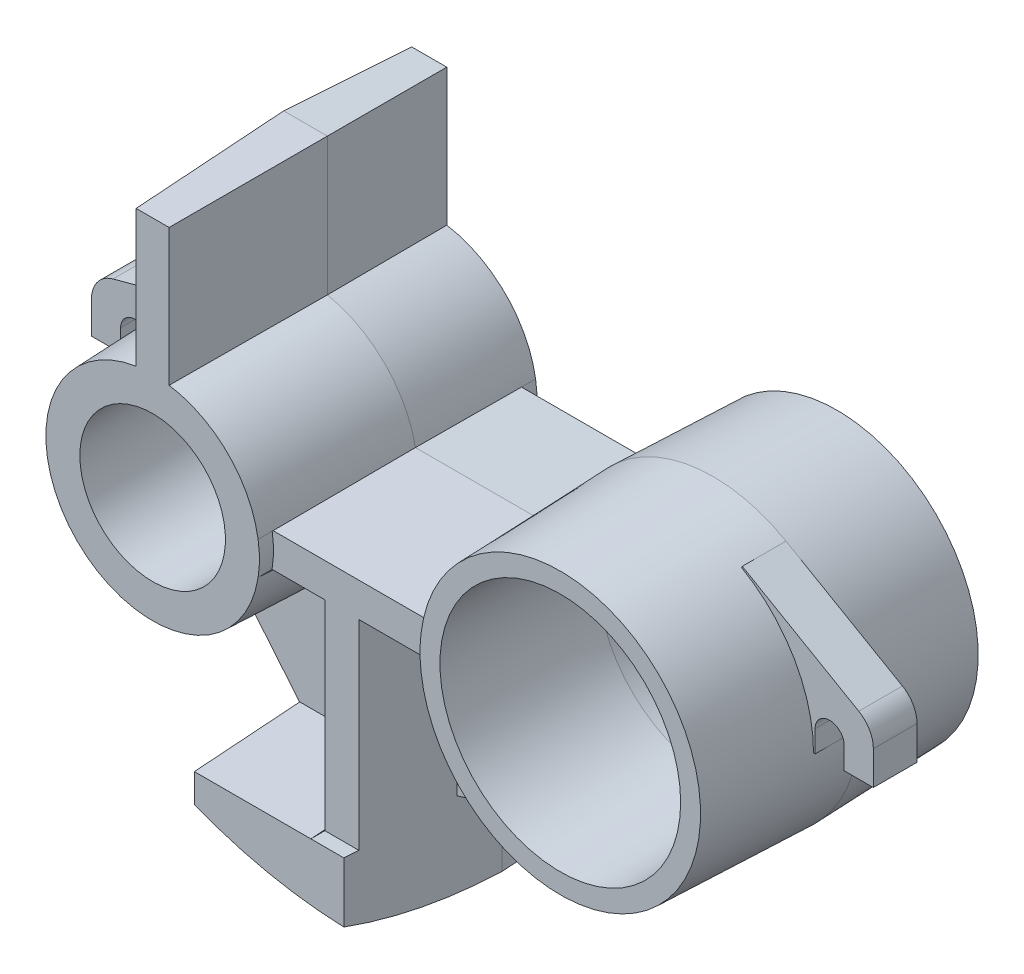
ISO-10303-21;
HEADER;
FILE_DESCRIPTION(('STEP AP214'),'2;1');
FILE_NAME('part.step','',(''),(''),'','','');
FILE_SCHEMA(('AUTOMOTIVE_DESIGN { 1 0 10303 214 1 1 1 1 }'));
ENDSEC;
DATA;
#1=APPLICATION_CONTEXT('core data for automotive mechanical design processes');
#2=APPLICATION_PROTOCOL_DEFINITION('international standard','automotive_design',2000,#1);
#3=PRODUCT_CONTEXT('',#1,'mechanical');
#4=PRODUCT('Part','Part','',(#3));
#5=PRODUCT_RELATED_PRODUCT_CATEGORY('part','',(#4));
#6=PRODUCT_DEFINITION_FORMATION('','',#4);
#7=PRODUCT_DEFINITION_CONTEXT('part definition',#1,'design');
#8=PRODUCT_DEFINITION('design','',#6,#7);
#9=PRODUCT_DEFINITION_SHAPE('','',#8);
#10=(LENGTH_UNIT() NAMED_UNIT(*) SI_UNIT(.MILLI.,.METRE.));
#11=(NAMED_UNIT(*) PLANE_ANGLE_UNIT() SI_UNIT($,.RADIAN.));
#12=(NAMED_UNIT(*) SI_UNIT($,.STERADIAN.) SOLID_ANGLE_UNIT());
#13=UNCERTAINTY_MEASURE_WITH_UNIT(LENGTH_MEASURE(1.E-05),#10,'distance_accuracy_value','');
#14=(GEOMETRIC_REPRESENTATION_CONTEXT(3) GLOBAL_UNCERTAINTY_ASSIGNED_CONTEXT((#13)) GLOBAL_UNIT_ASSIGNED_CONTEXT((#10,
#11,#12)) REPRESENTATION_CONTEXT('',''));
#15=CARTESIAN_POINT('',(0.,0.,0.));
#16=DIRECTION('',(0.,0.,1.));
#17=DIRECTION('',(1.,0.,0.));
#18=AXIS2_PLACEMENT_3D('',#15,#16,#17);
#19=CARTESIAN_POINT('',(0.,0.,0.));
#20=DIRECTION('',(0.,0.,-1.));
#21=DIRECTION('',(1.,0.,0.));
#22=AXIS2_PLACEMENT_3D('',#19,#20,#21);
#23=CONICAL_SURFACE('',#22,7.7,0.0349065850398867);
#24=DIRECTION('',(0.034899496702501,0.,0.999390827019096));
#25=VECTOR('',#24,1.);
#26=CARTESIAN_POINT('',(0.,0.,220.49915027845));
#27=LINE('',#26,#25);
#28=CARTESIAN_POINT('',(-7.7,0.,0.));
#29=VERTEX_POINT('',#28);
#30=CARTESIAN_POINT('',(-7.59523769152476,0.,3.));
#31=VERTEX_POINT('',#30);
#32=EDGE_CURVE('E43',#29,#31,#27,.T.);
#33=ORIENTED_EDGE('',*,*,#32,.F.);
#34=CARTESIAN_POINT('',(0.,0.,0.));
#35=DIRECTION('',(0.,0.,1.));
#36=DIRECTION('',(1.,0.,0.));
#37=AXIS2_PLACEMENT_3D('',#34,#35,#36);
#38=CIRCLE('',#37,7.7);
#39=CARTESIAN_POINT('',(-4.10532984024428,-6.51431246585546,0.));
#40=VERTEX_POINT('',#39);
#41=EDGE_CURVE('E584',#29,#40,#38,.T.);
#42=ORIENTED_EDGE('',*,*,#41,.T.);
#43=CARTESIAN_POINT('',(-4.10531557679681,-6.51432971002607,-0.0002));
#44=CARTESIAN_POINT('',(-4.12316634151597,-6.49274855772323,0.250074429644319));
#45=CARTESIAN_POINT('',(-4.14129141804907,-6.47083576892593,0.500301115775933));
#46=CARTESIAN_POINT('',(-4.17816122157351,-6.42626104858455,1.00063711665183));
#47=CARTESIAN_POINT('',(-4.19690593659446,-6.40359913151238,1.25074643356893));
#48=CARTESIAN_POINT('',(-4.23508675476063,-6.35743942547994,1.75083583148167));
#49=CARTESIAN_POINT('',(-4.2545228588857,-6.33394163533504,2.00081591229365));
#50=CARTESIAN_POINT('',(-4.29418258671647,-6.28599396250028,2.50062702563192));
#51=CARTESIAN_POINT('',(-4.31440622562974,-6.26154406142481,2.75045805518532));
#52=CARTESIAN_POINT('',(-4.33507133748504,-6.23656043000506,3.0002));
#53=B_SPLINE_CURVE_WITH_KNOTS('',3,(#43,#44,#45,#46,#47,#48,#49,#50,#51,#52),.UNSPECIFIED.,.F.,
.F.,(4,2,2,2,4),(0.,0.755510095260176,1.51100560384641,2.2665021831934,3.02201335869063),.UNSPECIFIED.);
#54=CARTESIAN_POINT('',(-4.33505478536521,-6.23658044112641,3.));
#55=VERTEX_POINT('',#54);
#56=EDGE_CURVE('E741',#40,#55,#53,.T.);
#57=ORIENTED_EDGE('',*,*,#56,.T.);
#58=CARTESIAN_POINT('',(0.,0.,3.));
#59=DIRECTION('',(0.,0.,1.));
#60=DIRECTION('',(1.,0.,0.));
#61=AXIS2_PLACEMENT_3D('',#58,#59,#60);
#62=CIRCLE('',#61,7.59523769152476);
#63=CARTESIAN_POINT('',(7.46598602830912,-1.39523769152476,3.));
#64=VERTEX_POINT('',#63);
#65=EDGE_CURVE('E1209',#55,#64,#62,.T.);
#66=ORIENTED_EDGE('',*,*,#65,.T.);
#67=CARTESIAN_POINT('',(7.2452271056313,-1.13333192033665,10.5));
#68=CARTESIAN_POINT('',(7.29749870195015,-1.19444218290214,8.75003104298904));
#69=CARTESIAN_POINT('',(7.34923916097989,-1.25555298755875,7.00004656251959));
#70=CARTESIAN_POINT('',(7.45165780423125,-1.37777568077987,3.50004656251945));
#71=CARTESIAN_POINT('',(7.50233598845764,-1.43888756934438,1.7500310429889));
#72=CARTESIAN_POINT('',(7.55248303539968,-1.5,0.));
#73=B_SPLINE_CURVE_WITH_KNOTS('',3,(#67,#68,#69,#70,#71,#72),.UNSPECIFIED.,.F.,.F.,(4,2,4),(0.,
5.25544627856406,10.5108925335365),.UNSPECIFIED.);
#74=CARTESIAN_POINT('',(7.27504868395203,-1.1682526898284,9.5));
#75=VERTEX_POINT('',#74);
#76=EDGE_CURVE('E466',#75,#64,#73,.T.);
#77=ORIENTED_EDGE('',*,*,#76,.F.);
#78=CARTESIAN_POINT('',(7.2452271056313,-1.13333192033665,10.5));
#79=VERTEX_POINT('',#78);
#80=EDGE_CURVE('E457',#79,#75,#73,.T.);
#81=ORIENTED_EDGE('',*,*,#80,.F.);
#82=CARTESIAN_POINT('',(0.,0.,10.5));
#83=DIRECTION('',(0.,0.,1.));
#84=DIRECTION('',(1.,0.,0.));
#85=AXIS2_PLACEMENT_3D('',#82,#83,#84);
#86=CIRCLE('',#85,7.33333192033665);
#87=CARTESIAN_POINT('',(-1.13333192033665,7.2452271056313,10.5));
#88=VERTEX_POINT('',#87);
#89=EDGE_CURVE('E456',#88,#79,#86,.T.);
#90=ORIENTED_EDGE('',*,*,#89,.F.);
#91=CARTESIAN_POINT('',(-1.13333192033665,7.2452271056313,10.5));
#92=CARTESIAN_POINT('',(-1.19444218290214,7.29749870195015,8.75003104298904));
#93=CARTESIAN_POINT('',(-1.25555298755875,7.34923916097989,7.00004656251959));
#94=CARTESIAN_POINT('',(-1.37777568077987,7.45165780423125,3.50004656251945));
#95=CARTESIAN_POINT('',(-1.43888756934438,7.50233598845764,1.7500310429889));
#96=CARTESIAN_POINT('',(-1.5,7.55248303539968,0.));
#97=B_SPLINE_CURVE_WITH_KNOTS('',3,(#91,#92,#93,#94,#95,#96),.UNSPECIFIED.,.F.,.F.,(4,2,4),(0.,
5.25544627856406,10.5108925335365),.UNSPECIFIED.);
#98=CARTESIAN_POINT('',(-1.5,7.55248303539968,0.));
#99=VERTEX_POINT('',#98);
#100=EDGE_CURVE('E467',#88,#99,#97,.T.);
#101=ORIENTED_EDGE('',*,*,#100,.T.);
#102=CARTESIAN_POINT('',(-5.47299255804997,5.41630431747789,0.));
#103=VERTEX_POINT('',#102);
#104=EDGE_CURVE('E1080',#99,#103,#38,.T.);
#105=ORIENTED_EDGE('',*,*,#104,.T.);
#106=CARTESIAN_POINT('',(-5.26817449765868,5.47118515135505,3.0002));
#107=CARTESIAN_POINT('',(-5.3030334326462,5.46184472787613,2.50018603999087));
#108=CARTESIAN_POINT('',(-5.33753218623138,5.4526008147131,2.00014572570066));
#109=CARTESIAN_POINT('',(-5.405809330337,5.4343060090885,1.00001239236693));
#110=CARTESIAN_POINT('',(-5.43958772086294,5.42525511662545,0.499919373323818));
#111=CARTESIAN_POINT('',(-5.47300592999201,5.41630073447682,-0.00019999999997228));
#112=B_SPLINE_CURVE_WITH_KNOTS('',3,(#106,#107,#108,#109,#110,#111),.UNSPECIFIED.,.F.,.F.,(4,2,
4),(0.,1.50394260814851,3.00788520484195),.UNSPECIFIED.);
#113=CARTESIAN_POINT('',(-5.26818844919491,5.47118141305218,3.));
#114=VERTEX_POINT('',#113);
#115=EDGE_CURVE('E639',#114,#103,#112,.T.);
#116=ORIENTED_EDGE('',*,*,#115,.F.);
#117=CARTESIAN_POINT('',(0.,0.,3.));
#118=DIRECTION('',(0.,0.,-1.));
#119=DIRECTION('',(-1.,0.,0.));
#120=AXIS2_PLACEMENT_3D('',#117,#118,#119);
#121=CIRCLE('',#120,7.59523769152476);
#122=EDGE_CURVE('E593',#31,#114,#121,.T.);
#123=ORIENTED_EDGE('',*,*,#122,.F.);
#124=EDGE_LOOP('',(#33,#42,#57,#66,#77,#81,#90,#101,#105,#116,#123));
#125=FACE_BOUND('',#124,.T.);
#126=ADVANCED_FACE('F34',(#125),#23,.T.);
#127=CARTESIAN_POINT('',(28.,0.,0.));
#128=DIRECTION('',(0.,0.,-1.));
#129=DIRECTION('',(1.,0.,0.));
#130=AXIS2_PLACEMENT_3D('',#127,#128,#129);
#131=CONICAL_SURFACE('',#130,10.,0.0349065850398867);
#132=DIRECTION('',(0.034899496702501,0.,-0.999390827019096));
#133=VECTOR('',#132,1.);
#134=CARTESIAN_POINT('',(28.,0.,286.362532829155));
#135=LINE('',#134,#133);
#136=CARTESIAN_POINT('',(37.8952376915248,0.,3.));
#137=VERTEX_POINT('',#136);
#138=CARTESIAN_POINT('',(38.,0.,0.));
#139=VERTEX_POINT('',#138);
#140=EDGE_CURVE('E590',#137,#139,#135,.T.);
#141=ORIENTED_EDGE('',*,*,#140,.F.);
#142=CARTESIAN_POINT('',(28.,0.,3.));
#143=DIRECTION('',(0.,0.,1.));
#144=DIRECTION('',(1.,0.,0.));
#145=AXIS2_PLACEMENT_3D('',#142,#143,#144);
#146=CIRCLE('',#145,9.89523769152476);
#147=CARTESIAN_POINT('',(32.9476188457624,8.56952721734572,3.));
#148=VERTEX_POINT('',#147);
#149=EDGE_CURVE('E465',#137,#148,#146,.T.);
#150=ORIENTED_EDGE('',*,*,#149,.T.);
#151=DIRECTION('',(-0.0174497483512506,-0.0302238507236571,0.999390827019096));
#152=VECTOR('',#151,1.);
#153=CARTESIAN_POINT('',(28.,0.,286.362532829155));
#154=LINE('',#153,#152);
#155=CARTESIAN_POINT('',(33.,8.66025403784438,0.));
#156=VERTEX_POINT('',#155);
#157=EDGE_CURVE('E587',#156,#148,#154,.T.);
#158=ORIENTED_EDGE('',*,*,#157,.F.);
#159=CARTESIAN_POINT('',(28.,0.,0.));
#160=DIRECTION('',(0.,0.,1.));
#161=DIRECTION('',(1.,0.,0.));
#162=AXIS2_PLACEMENT_3D('',#159,#160,#161);
#163=CIRCLE('',#162,10.);
#164=CARTESIAN_POINT('',(18.1131400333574,1.5,0.));
#165=VERTEX_POINT('',#164);
#166=EDGE_CURVE('E436',#156,#165,#163,.T.);
#167=ORIENTED_EDGE('',*,*,#166,.T.);
#168=CARTESIAN_POINT('',(18.4335668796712,1.13333192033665,10.5));
#169=CARTESIAN_POINT('',(18.3792836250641,1.19444233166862,8.75002678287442));
#170=CARTESIAN_POINT('',(18.3254397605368,1.25555321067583,7.00004017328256));
#171=CARTESIAN_POINT('',(18.2186308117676,1.37777590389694,3.5000401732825));
#172=CARTESIAN_POINT('',(18.1656657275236,1.43888771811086,1.75002678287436));
#173=CARTESIAN_POINT('',(18.1131400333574,1.5,0.));
#174=B_SPLINE_CURVE_WITH_KNOTS('',3,(#168,#169,#170,#171,#172,#173),.UNSPECIFIED.,.F.,.F.,(4,2,
4),(0.,5.25564282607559,10.5112856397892),.UNSPECIFIED.);
#175=CARTESIAN_POINT('',(18.4025891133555,1.1682526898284,9.5));
#176=VERTEX_POINT('',#175);
#177=EDGE_CURVE('E513',#176,#165,#174,.T.);
#178=ORIENTED_EDGE('',*,*,#177,.F.);
#179=CARTESIAN_POINT('',(18.4335668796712,1.13333192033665,10.5));
#180=VERTEX_POINT('',#179);
#181=EDGE_CURVE('E515',#180,#176,#174,.T.);
#182=ORIENTED_EDGE('',*,*,#181,.F.);
#183=CARTESIAN_POINT('',(28.,0.,10.5));
#184=DIRECTION('',(0.,0.,1.));
#185=DIRECTION('',(1.,0.,0.));
#186=AXIS2_PLACEMENT_3D('',#183,#184,#185);
#187=CIRCLE('',#186,9.63333192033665);
#188=CARTESIAN_POINT('',(18.4335668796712,-1.13333192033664,10.5));
#189=VERTEX_POINT('',#188);
#190=EDGE_CURVE('E570',#189,#180,#187,.T.);
#191=ORIENTED_EDGE('',*,*,#190,.F.);
#192=CARTESIAN_POINT('',(18.4335668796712,-1.13333192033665,10.5));
#193=CARTESIAN_POINT('',(18.3792836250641,-1.19444233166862,8.75002678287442));
#194=CARTESIAN_POINT('',(18.3254397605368,-1.25555321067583,7.00004017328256));
#195=CARTESIAN_POINT('',(18.2186308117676,-1.37777590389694,3.5000401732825));
#196=CARTESIAN_POINT('',(18.1656657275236,-1.43888771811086,1.75002678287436));
#197=CARTESIAN_POINT('',(18.1131400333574,-1.5,0.));
#198=B_SPLINE_CURVE_WITH_KNOTS('',3,(#192,#193,#194,#195,#196,#197),.UNSPECIFIED.,.F.,.F.,(4,2,
4),(0.,5.25564282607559,10.5112856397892),.UNSPECIFIED.);
#199=CARTESIAN_POINT('',(18.4025891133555,-1.1682526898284,9.5));
#200=VERTEX_POINT('',#199);
#201=EDGE_CURVE('E540',#189,#200,#198,.T.);
#202=ORIENTED_EDGE('',*,*,#201,.T.);
#203=CARTESIAN_POINT('',(18.2036210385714,-1.39523769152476,3.));
#204=VERTEX_POINT('',#203);
#205=EDGE_CURVE('E548',#200,#204,#198,.T.);
#206=ORIENTED_EDGE('',*,*,#205,.T.);
#207=CARTESIAN_POINT('',(28.,0.,3.));
#208=DIRECTION('',(0.,0.,1.));
#209=DIRECTION('',(1.,0.,0.));
#210=AXIS2_PLACEMENT_3D('',#207,#208,#209);
#211=CIRCLE('',#210,9.89523769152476);
#212=CARTESIAN_POINT('',(31.5133624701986,-9.25051420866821,3.));
#213=VERTEX_POINT('',#212);
#214=EDGE_CURVE('E1132',#204,#213,#211,.T.);
#215=ORIENTED_EDGE('',*,*,#214,.T.);
#216=CARTESIAN_POINT('',(31.5133604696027,-9.25050749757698,3.0002));
#217=CARTESIAN_POINT('',(31.518362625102,-9.2672874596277,2.50013335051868));
#218=CARTESIAN_POINT('',(31.523364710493,-9.28406718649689,2.00006669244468));
#219=CARTESIAN_POINT('',(31.5333687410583,-9.31762616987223,0.999933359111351));
#220=CARTESIAN_POINT('',(31.5383706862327,-9.33440542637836,0.499866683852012));
#221=CARTESIAN_POINT('',(31.5433725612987,-9.35118444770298,-0.000199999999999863));
#222=B_SPLINE_CURVE_WITH_KNOTS('',3,(#216,#217,#218,#219,#220,#221),.UNSPECIFIED.,.F.,.F.,(4,2,
4),(0.,1.50111931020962,3.00223862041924),.UNSPECIFIED.);
#223=CARTESIAN_POINT('',(31.5433705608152,-9.35117773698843,0.));
#224=VERTEX_POINT('',#223);
#225=EDGE_CURVE('E768',#213,#224,#222,.T.);
#226=ORIENTED_EDGE('',*,*,#225,.T.);
#227=EDGE_CURVE('E441',#224,#139,#163,.T.);
#228=ORIENTED_EDGE('',*,*,#227,.T.);
#229=EDGE_LOOP('',(#141,#150,#158,#167,#178,#182,#191,#202,#206,#215,#226,#228));
#230=FACE_BOUND('',#229,.T.);
#231=ADVANCED_FACE('F528',(#230),#131,.T.);
#232=CARTESIAN_POINT('',(7.55248303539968,1.5,0.));
#233=DIRECTION('',(0.,0.999390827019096,-0.034899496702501));
#234=DIRECTION('',(0.,0.034899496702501,0.999390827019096));
#235=AXIS2_PLACEMENT_3D('',#232,#233,#234);
#236=PLANE('',#235);
#237=CARTESIAN_POINT('',(18.371711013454,1.20317345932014,-8.5));
#238=CARTESIAN_POINT('',(18.3280454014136,1.2526439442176,-7.0833506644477));
#239=CARTESIAN_POINT('',(18.2846650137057,1.30211473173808,-5.66669266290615));
#240=CARTESIAN_POINT('',(18.1984746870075,1.4010569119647,-2.83335932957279));
#241=CARTESIAN_POINT('',(18.1556647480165,1.45052830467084,-1.41668399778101));
#242=CARTESIAN_POINT('',(18.1131400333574,1.5,0.));
#243=B_SPLINE_CURVE_WITH_KNOTS('',3,(#237,#238,#239,#240,#241,#242),.UNSPECIFIED.,.F.,.F.,(4,2,
4),(0.,4.25455543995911,8.50911087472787),.UNSPECIFIED.);
#244=CARTESIAN_POINT('',(18.3409316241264,1.23809422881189,-7.5));
#245=VERTEX_POINT('',#244);
#246=EDGE_CURVE('E1018',#245,#165,#243,.T.);
#247=ORIENTED_EDGE('',*,*,#246,.F.);
#248=DIRECTION('',(1.,0.,0.));
#249=VECTOR('',#248,1.);
#250=CARTESIAN_POINT('',(28.,1.23809422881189,-7.5));
#251=LINE('',#250,#249);
#252=CARTESIAN_POINT('',(7.334328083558,1.23809422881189,-7.5));
#253=VERTEX_POINT('',#252);
#254=EDGE_CURVE('E874',#253,#245,#251,.T.);
#255=ORIENTED_EDGE('',*,*,#254,.F.);
#256=CARTESIAN_POINT('',(7.30474851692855,1.20317345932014,-8.5));
#257=CARTESIAN_POINT('',(7.34672544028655,1.25264385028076,-7.08335335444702));
#258=CARTESIAN_POINT('',(7.38835844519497,1.30211459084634,-5.66669669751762));
#259=CARTESIAN_POINT('',(7.47093661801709,1.40105677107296,-2.83336336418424));
#260=CARTESIAN_POINT('',(7.51188178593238,1.450528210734,-1.4166866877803));
#261=CARTESIAN_POINT('',(7.55248303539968,1.5,0.));
#262=B_SPLINE_CURVE_WITH_KNOTS('',3,(#256,#257,#258,#259,#260,#261),.UNSPECIFIED.,.F.,.F.,(4,2,
4),(0.,4.25439428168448,8.50878855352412),.UNSPECIFIED.);
#263=CARTESIAN_POINT('',(7.55248303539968,1.5,0.));
#264=VERTEX_POINT('',#263);
#265=EDGE_CURVE('E1017',#253,#264,#262,.T.);
#266=ORIENTED_EDGE('',*,*,#265,.T.);
#267=DIRECTION('',(-1.,0.,0.));
#268=VECTOR('',#267,1.);
#269=CARTESIAN_POINT('',(7.55248303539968,1.5,0.));
#270=LINE('',#269,#268);
#271=EDGE_CURVE('E440',#165,#264,#270,.T.);
#272=ORIENTED_EDGE('',*,*,#271,.F.);
#273=EDGE_LOOP('',(#247,#255,#266,#272));
#274=FACE_BOUND('',#273,.T.);
#275=ADVANCED_FACE('F533',(#274),#236,.T.);
#276=CARTESIAN_POINT('',(13.5,-1.5,0.));
#277=DIRECTION('',(0.,-0.999390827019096,-0.034899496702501));
#278=DIRECTION('',(0.,0.034899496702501,-0.999390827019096));
#279=AXIS2_PLACEMENT_3D('',#276,#277,#278);
#280=PLANE('',#279);
#281=DIRECTION('',(0.0348782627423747,-0.0348782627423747,0.998782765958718));
#282=VECTOR('',#281,1.);
#283=CARTESIAN_POINT('',(13.5,-1.5,0.));
#284=LINE('',#283,#282);
#285=CARTESIAN_POINT('',(13.2380942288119,-1.23809422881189,-7.5));
#286=VERTEX_POINT('',#285);
#287=CARTESIAN_POINT('',(13.5,-1.5,0.));
#288=VERTEX_POINT('',#287);
#289=EDGE_CURVE('E1099',#286,#288,#284,.T.);
#290=ORIENTED_EDGE('',*,*,#289,.F.);
#291=DIRECTION('',(-1.,0.,0.));
#292=VECTOR('',#291,1.);
#293=CARTESIAN_POINT('',(28.,-1.23809422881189,-7.5));
#294=LINE('',#293,#292);
#295=CARTESIAN_POINT('',(18.3409316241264,-1.23809422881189,-7.5));
#296=VERTEX_POINT('',#295);
#297=EDGE_CURVE('E867',#296,#286,#294,.T.);
#298=ORIENTED_EDGE('',*,*,#297,.F.);
#299=CARTESIAN_POINT('',(18.371711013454,-1.20317345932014,-8.5));
#300=CARTESIAN_POINT('',(18.3280454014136,-1.2526439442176,-7.0833506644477));
#301=CARTESIAN_POINT('',(18.2846650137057,-1.30211473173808,-5.66669266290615));
#302=CARTESIAN_POINT('',(18.1984746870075,-1.4010569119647,-2.83335932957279));
#303=CARTESIAN_POINT('',(18.1556647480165,-1.45052830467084,-1.41668399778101));
#304=CARTESIAN_POINT('',(18.1131400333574,-1.5,0.));
#305=B_SPLINE_CURVE_WITH_KNOTS('',3,(#299,#300,#301,#302,#303,#304),.UNSPECIFIED.,.F.,.F.,(4,2,
4),(0.,4.25455543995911,8.50911087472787),.UNSPECIFIED.);
#306=CARTESIAN_POINT('',(18.1131400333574,-1.5,0.));
#307=VERTEX_POINT('',#306);
#308=EDGE_CURVE('E1101',#296,#307,#305,.T.);
#309=ORIENTED_EDGE('',*,*,#308,.T.);
#310=DIRECTION('',(1.,0.,0.));
#311=VECTOR('',#310,1.);
#312=CARTESIAN_POINT('',(13.5,-1.5,0.));
#313=LINE('',#312,#311);
#314=EDGE_CURVE('E433',#288,#307,#313,.T.);
#315=ORIENTED_EDGE('',*,*,#314,.F.);
#316=EDGE_LOOP('',(#290,#298,#309,#315));
#317=FACE_BOUND('',#316,.T.);
#318=ADVANCED_FACE('F998',(#317),#280,.T.);
#319=CARTESIAN_POINT('',(10.5,-1.5,0.));
#320=DIRECTION('',(-0.999390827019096,0.,-0.034899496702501));
#321=DIRECTION('',(-0.034899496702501,0.,0.999390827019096));
#322=AXIS2_PLACEMENT_3D('',#319,#320,#321);
#323=PLANE('',#322);
#324=DIRECTION('',(-0.0348782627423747,-0.0348782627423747,0.998782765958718));
#325=VECTOR('',#324,1.);
#326=CARTESIAN_POINT('',(10.5,-1.5,0.));
#327=LINE('',#326,#325);
#328=CARTESIAN_POINT('',(10.7619057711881,-1.23809422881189,-7.5));
#329=VERTEX_POINT('',#328);
#330=CARTESIAN_POINT('',(10.5,-1.5,0.));
#331=VERTEX_POINT('',#330);
#332=EDGE_CURVE('E982',#329,#331,#327,.T.);
#333=ORIENTED_EDGE('',*,*,#332,.F.);
#334=DIRECTION('',(0.,1.,0.));
#335=VECTOR('',#334,1.);
#336=CARTESIAN_POINT('',(10.7619057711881,0.,-7.5));
#337=LINE('',#336,#335);
#338=CARTESIAN_POINT('',(10.7619057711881,-14.7619057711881,-7.5));
#339=VERTEX_POINT('',#338);
#340=EDGE_CURVE('E857',#339,#329,#337,.T.);
#341=ORIENTED_EDGE('',*,*,#340,.F.);
#342=DIRECTION('',(-0.0348782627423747,0.0348782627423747,0.998782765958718));
#343=VECTOR('',#342,1.);
#344=CARTESIAN_POINT('',(10.4902680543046,-14.4902680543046,0.278686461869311));
#345=LINE('',#344,#343);
#346=CARTESIAN_POINT('',(10.5,-14.5,0.));
#347=VERTEX_POINT('',#346);
#348=EDGE_CURVE('E1094',#339,#347,#345,.T.);
#349=ORIENTED_EDGE('',*,*,#348,.T.);
#350=DIRECTION('',(0.,-1.,0.));
#351=VECTOR('',#350,1.);
#352=CARTESIAN_POINT('',(10.5,-1.5,0.));
#353=LINE('',#352,#351);
#354=EDGE_CURVE('E423',#331,#347,#353,.T.);
#355=ORIENTED_EDGE('',*,*,#354,.F.);
#356=EDGE_LOOP('',(#333,#341,#349,#355));
#357=FACE_BOUND('',#356,.T.);
#358=ADVANCED_FACE('F989',(#357),#323,.T.);
#359=CARTESIAN_POINT('',(7.55248303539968,-1.5,0.));
#360=DIRECTION('',(0.,-0.999390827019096,-0.034899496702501));
#361=DIRECTION('',(0.,0.034899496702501,-0.999390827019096));
#362=AXIS2_PLACEMENT_3D('',#359,#360,#361);
#363=PLANE('',#362);
#364=CARTESIAN_POINT('',(7.30474851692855,-1.20317345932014,-8.5));
#365=CARTESIAN_POINT('',(7.34672544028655,-1.25264385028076,-7.08335335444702));
#366=CARTESIAN_POINT('',(7.38835844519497,-1.30211459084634,-5.66669669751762));
#367=CARTESIAN_POINT('',(7.47093661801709,-1.40105677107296,-2.83336336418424));
#368=CARTESIAN_POINT('',(7.51188178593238,-1.450528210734,-1.4166866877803));
#369=CARTESIAN_POINT('',(7.55248303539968,-1.5,0.));
#370=B_SPLINE_CURVE_WITH_KNOTS('',3,(#364,#365,#366,#367,#368,#369),.UNSPECIFIED.,.F.,.F.,(4,2,
4),(0.,4.25439428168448,8.50878855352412),.UNSPECIFIED.);
#371=CARTESIAN_POINT('',(7.33432808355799,-1.23809422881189,-7.5));
#372=VERTEX_POINT('',#371);
#373=CARTESIAN_POINT('',(7.55248303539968,-1.5,0.));
#374=VERTEX_POINT('',#373);
#375=EDGE_CURVE('E983',#372,#374,#370,.T.);
#376=ORIENTED_EDGE('',*,*,#375,.F.);
#377=DIRECTION('',(-1.,0.,0.));
#378=VECTOR('',#377,1.);
#379=CARTESIAN_POINT('',(28.,-1.2380942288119,-7.5));
#380=LINE('',#379,#378);
#381=EDGE_CURVE('E850',#329,#372,#380,.T.);
#382=ORIENTED_EDGE('',*,*,#381,.F.);
#383=ORIENTED_EDGE('',*,*,#332,.T.);
#384=DIRECTION('',(1.,0.,0.));
#385=VECTOR('',#384,1.);
#386=CARTESIAN_POINT('',(7.55248303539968,-1.5,0.));
#387=LINE('',#386,#385);
#388=EDGE_CURVE('E1082',#374,#331,#387,.T.);
#389=ORIENTED_EDGE('',*,*,#388,.F.);
#390=EDGE_LOOP('',(#376,#382,#383,#389));
#391=FACE_BOUND('',#390,.T.);
#392=ADVANCED_FACE('F985',(#391),#363,.T.);
#393=CARTESIAN_POINT('',(0.,0.,-8.5));
#394=DIRECTION('',(0.,0.,1.));
#395=DIRECTION('',(1.,0.,0.));
#396=AXIS2_PLACEMENT_3D('',#393,#394,#395);
#397=PLANE('',#396);
#398=DIRECTION('',(0.,1.,0.));
#399=VECTOR('',#398,1.);
#400=CARTESIAN_POINT('',(13.2031734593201,0.,-8.5));
#401=LINE('',#400,#399);
#402=CARTESIAN_POINT('',(13.2031734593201,-19.5969205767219,-8.5));
#403=VERTEX_POINT('',#402);
#404=CARTESIAN_POINT('',(13.2031734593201,-14.7968265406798,-8.5));
#405=VERTEX_POINT('',#404);
#406=EDGE_CURVE('E1071',#403,#405,#401,.T.);
#407=ORIENTED_EDGE('',*,*,#406,.F.);
#408=CARTESIAN_POINT('',(14.2293094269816,11.7550657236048,-8.5));
#409=DIRECTION('',(0.,0.,1.));
#410=DIRECTION('',(1.,0.,0.));
#411=AXIS2_PLACEMENT_3D('',#408,#409,#410);
#412=CIRCLE('',#411,31.3687742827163);
#413=CARTESIAN_POINT('',(2.79682654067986,-17.4562049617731,-8.5));
#414=VERTEX_POINT('',#413);
#415=EDGE_CURVE('E1844',#403,#414,#412,.F.);
#416=ORIENTED_EDGE('',*,*,#415,.T.);
#417=DIRECTION('',(0.,-1.,0.));
#418=VECTOR('',#417,1.);
#419=CARTESIAN_POINT('',(2.79682654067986,0.,-8.5));
#420=LINE('',#419,#418);
#421=CARTESIAN_POINT('',(2.79682654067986,-14.7968265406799,-8.5));
#422=VERTEX_POINT('',#421);
#423=EDGE_CURVE('E1073',#422,#414,#420,.T.);
#424=ORIENTED_EDGE('',*,*,#423,.F.);
#425=DIRECTION('',(-1.,0.,0.));
#426=VECTOR('',#425,1.);
#427=CARTESIAN_POINT('',(0.,-14.7968265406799,-8.5));
#428=LINE('',#427,#426);
#429=CARTESIAN_POINT('',(10.7968265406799,-14.7968265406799,-8.5));
#430=VERTEX_POINT('',#429);
#431=EDGE_CURVE('E1054',#430,#422,#428,.T.);
#432=ORIENTED_EDGE('',*,*,#431,.F.);
#433=DIRECTION('',(-1.,0.,0.));
#434=VECTOR('',#433,1.);
#435=CARTESIAN_POINT('',(10.7968265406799,-14.7968265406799,-8.5));
#436=LINE('',#435,#434);
#437=EDGE_CURVE('E810',#405,#430,#436,.T.);
#438=ORIENTED_EDGE('',*,*,#437,.F.);
#439=EDGE_LOOP('',(#407,#416,#424,#432,#438));
#440=FACE_BOUND('',#439,.T.);
#441=ADVANCED_FACE('F956',(#440),#397,.F.);
#442=CARTESIAN_POINT('',(28.,0.,-8.5));
#443=DIRECTION('',(0.,0.,1.));
#444=DIRECTION('',(1.,0.,0.));
#445=AXIS2_PLACEMENT_3D('',#442,#443,#444);
#446=CIRCLE('',#445,8.19682654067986);
#447=CARTESIAN_POINT('',(36.1968265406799,0.,-8.5));
#448=VERTEX_POINT('',#447);
#449=EDGE_CURVE('E1055',#448,#448,#446,.T.);
#450=ORIENTED_EDGE('',*,*,#449,.T.);
#451=EDGE_LOOP('',(#450));
#452=FACE_BOUND('',#451,.T.);
#453=CARTESIAN_POINT('',(28.,0.,-8.5));
#454=DIRECTION('',(0.,0.,1.));
#455=DIRECTION('',(1.,0.,0.));
#456=AXIS2_PLACEMENT_3D('',#453,#454,#455);
#457=CIRCLE('',#456,9.70317345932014);
#458=CARTESIAN_POINT('',(18.371711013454,-1.20317345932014,-8.5));
#459=VERTEX_POINT('',#458);
#460=CARTESIAN_POINT('',(18.371711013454,1.20317345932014,-8.5));
#461=VERTEX_POINT('',#460);
#462=EDGE_CURVE('E1068',#459,#461,#457,.T.);
#463=ORIENTED_EDGE('',*,*,#462,.F.);
#464=CARTESIAN_POINT('',(28.,0.,-8.5));
#465=DIRECTION('',(0.,0.,1.));
#466=DIRECTION('',(-1.,0.,0.));
#467=AXIS2_PLACEMENT_3D('',#464,#465,#466);
#468=CIRCLE('',#467,9.70317345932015);
#469=EDGE_CURVE('E1148',#461,#459,#468,.T.);
#470=ORIENTED_EDGE('',*,*,#469,.F.);
#471=EDGE_LOOP('',(#463,#470));
#472=FACE_BOUND('',#471,.T.);
#473=ADVANCED_FACE('F957',(#452,#472),#397,.F.);
#474=CARTESIAN_POINT('',(0.,0.,10.5));
#475=DIRECTION('',(0.,0.,1.));
#476=DIRECTION('',(1.,0.,0.));
#477=AXIS2_PLACEMENT_3D('',#474,#475,#476);
#478=PLANE('',#477);
#479=CARTESIAN_POINT('',(14.2293094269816,11.7550657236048,10.5));
#480=DIRECTION('',(0.,0.,1.));
#481=DIRECTION('',(1.,0.,0.));
#482=AXIS2_PLACEMENT_3D('',#479,#480,#481);
#483=CIRCLE('',#482,30.7571129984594);
#484=CARTESIAN_POINT('',(13.1333319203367,-18.9825144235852,10.5));
#485=VERTEX_POINT('',#484);
#486=CARTESIAN_POINT('',(2.86666807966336,-16.8262285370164,10.5));
#487=VERTEX_POINT('',#486);
#488=EDGE_CURVE('E1241',#485,#487,#483,.F.);
#489=ORIENTED_EDGE('',*,*,#488,.F.);
#490=DIRECTION('',(0.,-1.,0.));
#491=VECTOR('',#490,1.);
#492=CARTESIAN_POINT('',(13.1333319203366,-1.5,10.5));
#493=LINE('',#492,#491);
#494=CARTESIAN_POINT('',(13.1333319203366,-14.8666680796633,10.5));
#495=VERTEX_POINT('',#494);
#496=EDGE_CURVE('E568',#485,#495,#493,.F.);
#497=ORIENTED_EDGE('',*,*,#496,.T.);
#498=DIRECTION('',(1.,0.,0.));
#499=VECTOR('',#498,1.);
#500=CARTESIAN_POINT('',(10.8666680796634,-14.8666680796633,10.5));
#501=LINE('',#500,#499);
#502=CARTESIAN_POINT('',(10.8666680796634,-14.8666680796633,10.5));
#503=VERTEX_POINT('',#502);
#504=EDGE_CURVE('E883',#503,#495,#501,.T.);
#505=ORIENTED_EDGE('',*,*,#504,.F.);
#506=DIRECTION('',(1.,0.,0.));
#507=VECTOR('',#506,1.);
#508=CARTESIAN_POINT('',(2.5,-14.8666680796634,10.5));
#509=LINE('',#508,#507);
#510=CARTESIAN_POINT('',(2.86666807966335,-14.8666680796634,10.5));
#511=VERTEX_POINT('',#510);
#512=EDGE_CURVE('E563',#503,#511,#509,.F.);
#513=ORIENTED_EDGE('',*,*,#512,.T.);
#514=DIRECTION('',(0.,1.,0.));
#515=VECTOR('',#514,1.);
#516=CARTESIAN_POINT('',(2.86666807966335,-21.7024699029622,10.5));
#517=LINE('',#516,#515);
#518=EDGE_CURVE('E565',#511,#487,#517,.F.);
#519=ORIENTED_EDGE('',*,*,#518,.T.);
#520=EDGE_LOOP('',(#489,#497,#505,#513,#519));
#521=FACE_BOUND('',#520,.T.);
#522=ADVANCED_FACE('F1240',(#521),#478,.T.);
#523=CARTESIAN_POINT('',(0.,0.,10.5));
#524=DIRECTION('',(0.,0.,-1.));
#525=DIRECTION('',(-1.,0.,0.));
#526=AXIS2_PLACEMENT_3D('',#523,#524,#525);
#527=CIRCLE('',#526,5.);
#528=CARTESIAN_POINT('',(-5.,0.,10.5));
#529=VERTEX_POINT('',#528);
#530=EDGE_CURVE('E1856',#529,#529,#527,.T.);
#531=ORIENTED_EDGE('',*,*,#530,.T.);
#532=EDGE_LOOP('',(#531));
#533=FACE_BOUND('',#532,.T.);
#534=CARTESIAN_POINT('',(0.,0.,10.5));
#535=DIRECTION('',(0.,0.,-1.));
#536=DIRECTION('',(1.,0.,0.));
#537=AXIS2_PLACEMENT_3D('',#534,#535,#536);
#538=CIRCLE('',#537,7.33333192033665);
#539=CARTESIAN_POINT('',(7.2452271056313,1.13333192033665,10.5));
#540=VERTEX_POINT('',#539);
#541=EDGE_CURVE('E880',#540,#79,#538,.T.);
#542=ORIENTED_EDGE('',*,*,#541,.F.);
#543=CARTESIAN_POINT('',(0.,0.,10.5));
#544=DIRECTION('',(0.,0.,1.));
#545=DIRECTION('',(1.,0.,0.));
#546=AXIS2_PLACEMENT_3D('',#543,#544,#545);
#547=CIRCLE('',#546,7.33333192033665);
#548=CARTESIAN_POINT('',(1.13333192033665,7.2452271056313,10.5));
#549=VERTEX_POINT('',#548);
#550=EDGE_CURVE('E573',#540,#549,#547,.T.);
#551=ORIENTED_EDGE('',*,*,#550,.T.);
#552=DIRECTION('',(0.,-1.,0.));
#553=VECTOR('',#552,1.);
#554=CARTESIAN_POINT('',(1.13333192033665,7.55248303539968,10.5));
#555=LINE('',#554,#553);
#556=CARTESIAN_POINT('',(1.13333192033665,16.6333319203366,10.5));
#557=VERTEX_POINT('',#556);
#558=EDGE_CURVE('E575',#549,#557,#555,.F.);
#559=ORIENTED_EDGE('',*,*,#558,.T.);
#560=DIRECTION('',(1.,0.,0.));
#561=VECTOR('',#560,1.);
#562=CARTESIAN_POINT('',(1.5,16.6333319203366,10.5));
#563=LINE('',#562,#561);
#564=CARTESIAN_POINT('',(-1.13333192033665,16.6333319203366,10.5));
#565=VERTEX_POINT('',#564);
#566=EDGE_CURVE('E577',#557,#565,#563,.F.);
#567=ORIENTED_EDGE('',*,*,#566,.T.);
#568=DIRECTION('',(0.,1.,0.));
#569=VECTOR('',#568,1.);
#570=CARTESIAN_POINT('',(-1.13333192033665,7.55248303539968,10.5));
#571=LINE('',#570,#569);
#572=EDGE_CURVE('E579',#565,#88,#571,.F.);
#573=ORIENTED_EDGE('',*,*,#572,.T.);
#574=ORIENTED_EDGE('',*,*,#89,.T.);
#575=EDGE_LOOP('',(#542,#551,#559,#567,#573,#574));
#576=FACE_BOUND('',#575,.T.);
#577=ADVANCED_FACE('F480',(#533,#576),#478,.T.);
#578=CARTESIAN_POINT('',(7.55248303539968,-1.5,0.));
#579=DIRECTION('',(0.,-0.999390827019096,0.034899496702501));
#580=DIRECTION('',(0.,-0.034899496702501,-0.999390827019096));
#581=AXIS2_PLACEMENT_3D('',#578,#579,#580);
#582=PLANE('',#581);
#583=ORIENTED_EDGE('',*,*,#76,.T.);
#584=DIRECTION('',(-1.,0.,0.));
#585=VECTOR('',#584,1.);
#586=CARTESIAN_POINT('',(7.55248303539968,-1.39523769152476,3.));
#587=LINE('',#586,#585);
#588=CARTESIAN_POINT('',(10.6047623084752,-1.39523769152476,3.));
#589=VERTEX_POINT('',#588);
#590=EDGE_CURVE('E1211',#64,#589,#587,.F.);
#591=ORIENTED_EDGE('',*,*,#590,.T.);
#592=DIRECTION('',(-0.0348782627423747,-0.0348782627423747,-0.998782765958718));
#593=VECTOR('',#592,1.);
#594=CARTESIAN_POINT('',(10.4964143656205,-1.50358563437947,-0.102679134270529));
#595=LINE('',#594,#593);
#596=CARTESIAN_POINT('',(10.8317473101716,-1.1682526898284,9.5));
#597=VERTEX_POINT('',#596);
#598=EDGE_CURVE('E558',#597,#589,#595,.T.);
#599=ORIENTED_EDGE('',*,*,#598,.F.);
#600=DIRECTION('',(1.,0.,0.));
#601=VECTOR('',#600,1.);
#602=CARTESIAN_POINT('',(28.,-1.1682526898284,9.5));
#603=LINE('',#602,#601);
#604=EDGE_CURVE('E1266',#75,#597,#603,.T.);
#605=ORIENTED_EDGE('',*,*,#604,.F.);
#606=EDGE_LOOP('',(#583,#591,#599,#605));
#607=FACE_BOUND('',#606,.T.);
#608=ADVANCED_FACE('F476',(#607),#582,.T.);
#609=CARTESIAN_POINT('',(10.5,-1.5,0.));
#610=DIRECTION('',(-0.999390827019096,0.,0.034899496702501));
#611=DIRECTION('',(0.034899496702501,0.,0.999390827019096));
#612=AXIS2_PLACEMENT_3D('',#609,#610,#611);
#613=PLANE('',#612);
#614=ORIENTED_EDGE('',*,*,#598,.T.);
#615=DIRECTION('',(0.,1.,0.));
#616=VECTOR('',#615,1.);
#617=CARTESIAN_POINT('',(10.6047623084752,-1.5,3.));
#618=LINE('',#617,#616);
#619=CARTESIAN_POINT('',(10.6047623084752,-14.6047623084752,3.));
#620=VERTEX_POINT('',#619);
#621=EDGE_CURVE('E1215',#589,#620,#618,.F.);
#622=ORIENTED_EDGE('',*,*,#621,.T.);
#623=DIRECTION('',(-0.0348782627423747,0.0348782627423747,-0.998782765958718));
#624=VECTOR('',#623,1.);
#625=CARTESIAN_POINT('',(10.484185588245,-14.484185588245,-0.45286550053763));
#626=LINE('',#625,#624);
#627=CARTESIAN_POINT('',(10.8317473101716,-14.8317473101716,9.5));
#628=VERTEX_POINT('',#627);
#629=EDGE_CURVE('E554',#628,#620,#626,.T.);
#630=ORIENTED_EDGE('',*,*,#629,.F.);
#631=DIRECTION('',(0.,-1.,0.));
#632=VECTOR('',#631,1.);
#633=CARTESIAN_POINT('',(10.8317473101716,0.,9.5));
#634=LINE('',#633,#632);
#635=EDGE_CURVE('E1227',#597,#628,#634,.T.);
#636=ORIENTED_EDGE('',*,*,#635,.F.);
#637=EDGE_LOOP('',(#614,#622,#630,#636));
#638=FACE_BOUND('',#637,.T.);
#639=ADVANCED_FACE('F479',(#638),#613,.T.);
#640=CARTESIAN_POINT('',(13.5,-1.5,0.));
#641=DIRECTION('',(0.,-0.999390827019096,0.034899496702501));
#642=DIRECTION('',(0.,-0.034899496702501,-0.999390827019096));
#643=AXIS2_PLACEMENT_3D('',#640,#641,#642);
#644=PLANE('',#643);
#645=DIRECTION('',(0.0348782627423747,-0.0348782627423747,-0.998782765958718));
#646=VECTOR('',#645,1.);
#647=CARTESIAN_POINT('',(13.5,-1.5,0.));
#648=LINE('',#647,#646);
#649=CARTESIAN_POINT('',(13.1682526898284,-1.1682526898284,9.5));
#650=VERTEX_POINT('',#649);
#651=CARTESIAN_POINT('',(13.3952376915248,-1.39523769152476,3.));
#652=VERTEX_POINT('',#651);
#653=EDGE_CURVE('E547',#650,#652,#648,.T.);
#654=ORIENTED_EDGE('',*,*,#653,.T.);
#655=DIRECTION('',(-1.,0.,0.));
#656=VECTOR('',#655,1.);
#657=CARTESIAN_POINT('',(13.5,-1.39523769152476,3.));
#658=LINE('',#657,#656);
#659=EDGE_CURVE('E1140',#652,#204,#658,.F.);
#660=ORIENTED_EDGE('',*,*,#659,.T.);
#661=ORIENTED_EDGE('',*,*,#205,.F.);
#662=DIRECTION('',(1.,0.,0.));
#663=VECTOR('',#662,1.);
#664=CARTESIAN_POINT('',(28.,-1.1682526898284,9.5));
#665=LINE('',#664,#663);
#666=EDGE_CURVE('E1256',#650,#200,#665,.T.);
#667=ORIENTED_EDGE('',*,*,#666,.F.);
#668=EDGE_LOOP('',(#654,#660,#661,#667));
#669=FACE_BOUND('',#668,.T.);
#670=ADVANCED_FACE('F526',(#669),#644,.T.);
#671=CARTESIAN_POINT('',(7.55248303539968,1.5,0.));
#672=DIRECTION('',(0.,0.999390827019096,0.034899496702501));
#673=DIRECTION('',(0.,-0.034899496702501,0.999390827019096));
#674=AXIS2_PLACEMENT_3D('',#671,#672,#673);
#675=PLANE('',#674);
#676=ORIENTED_EDGE('',*,*,#177,.T.);
#677=ORIENTED_EDGE('',*,*,#271,.T.);
#678=CARTESIAN_POINT('',(7.2452271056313,1.13333192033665,10.5));
#679=CARTESIAN_POINT('',(7.29749870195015,1.19444218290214,8.75003104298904));
#680=CARTESIAN_POINT('',(7.34923916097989,1.25555298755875,7.00004656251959));
#681=CARTESIAN_POINT('',(7.45165780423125,1.37777568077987,3.50004656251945));
#682=CARTESIAN_POINT('',(7.50233598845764,1.43888756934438,1.7500310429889));
#683=CARTESIAN_POINT('',(7.55248303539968,1.5,0.));
#684=B_SPLINE_CURVE_WITH_KNOTS('',3,(#678,#679,#680,#681,#682,#683),.UNSPECIFIED.,.F.,.F.,(4,2,
4),(0.,5.25544627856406,10.5108925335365),.UNSPECIFIED.);
#685=CARTESIAN_POINT('',(7.27504868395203,1.1682526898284,9.5));
#686=VERTEX_POINT('',#685);
#687=EDGE_CURVE('E514',#686,#264,#684,.T.);
#688=ORIENTED_EDGE('',*,*,#687,.F.);
#689=DIRECTION('',(-1.,0.,0.));
#690=VECTOR('',#689,1.);
#691=CARTESIAN_POINT('',(28.,1.1682526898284,9.5));
#692=LINE('',#691,#690);
#693=EDGE_CURVE('E1125',#176,#686,#692,.T.);
#694=ORIENTED_EDGE('',*,*,#693,.F.);
#695=EDGE_LOOP('',(#676,#677,#688,#694));
#696=FACE_BOUND('',#695,.T.);
#697=ADVANCED_FACE('F522',(#696),#675,.T.);
#698=CARTESIAN_POINT('',(28.,0.,10.5));
#699=DIRECTION('',(0.,0.,-1.));
#700=DIRECTION('',(1.,0.,0.));
#701=AXIS2_PLACEMENT_3D('',#698,#699,#700);
#702=CIRCLE('',#701,9.63333192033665);
#703=EDGE_CURVE('E849',#189,#180,#702,.T.);
#704=ORIENTED_EDGE('',*,*,#703,.F.);
#705=ORIENTED_EDGE('',*,*,#190,.T.);
#706=EDGE_LOOP('',(#704,#705));
#707=FACE_BOUND('',#706,.T.);
#708=CARTESIAN_POINT('',(28.,0.,10.5));
#709=DIRECTION('',(0.,0.,1.));
#710=DIRECTION('',(1.,0.,0.));
#711=AXIS2_PLACEMENT_3D('',#708,#709,#710);
#712=CIRCLE('',#711,8.26666807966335);
#713=CARTESIAN_POINT('',(36.2666680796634,0.,10.5));
#714=VERTEX_POINT('',#713);
#715=EDGE_CURVE('E581',#714,#714,#712,.T.);
#716=ORIENTED_EDGE('',*,*,#715,.F.);
#717=EDGE_LOOP('',(#716));
#718=FACE_BOUND('',#717,.T.);
#719=ADVANCED_FACE('F525',(#707,#718),#478,.T.);
#720=CARTESIAN_POINT('',(2.5,-14.5,0.));
#721=DIRECTION('',(0.,0.999390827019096,0.034899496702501));
#722=DIRECTION('',(0.,-0.034899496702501,0.999390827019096));
#723=AXIS2_PLACEMENT_3D('',#720,#721,#722);
#724=PLANE('',#723);
#725=ORIENTED_EDGE('',*,*,#629,.T.);
#726=DIRECTION('',(1.,0.,0.));
#727=VECTOR('',#726,1.);
#728=CARTESIAN_POINT('',(2.5,-14.6047623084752,3.));
#729=LINE('',#728,#727);
#730=CARTESIAN_POINT('',(2.60476230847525,-14.6047623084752,3.));
#731=VERTEX_POINT('',#730);
#732=EDGE_CURVE('E1213',#620,#731,#729,.F.);
#733=ORIENTED_EDGE('',*,*,#732,.T.);
#734=DIRECTION('',(-0.0348782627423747,0.0348782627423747,-0.998782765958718));
#735=VECTOR('',#734,1.);
#736=CARTESIAN_POINT('',(2.50876175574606,-14.5087617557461,0.250903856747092));
#737=LINE('',#736,#735);
#738=EDGE_CURVE('E551',#511,#731,#737,.T.);
#739=ORIENTED_EDGE('',*,*,#738,.F.);
#740=ORIENTED_EDGE('',*,*,#512,.F.);
#741=EDGE_CURVE('E555',#503,#628,#626,.T.);
#742=ORIENTED_EDGE('',*,*,#741,.T.);
#743=EDGE_LOOP('',(#725,#733,#739,#740,#742));
#744=FACE_BOUND('',#743,.T.);
#745=ADVANCED_FACE('F1232',(#744),#724,.T.);
#746=CARTESIAN_POINT('',(2.5,-21.7024699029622,0.));
#747=DIRECTION('',(-0.999390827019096,0.,0.034899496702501));
#748=DIRECTION('',(0.0348994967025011,0.,0.999390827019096));
#749=AXIS2_PLACEMENT_3D('',#746,#747,#748);
#750=PLANE('',#749);
#751=DIRECTION('',(0.,-1.,0.));
#752=VECTOR('',#751,1.);
#753=CARTESIAN_POINT('',(2.5,-21.7024699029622,0.));
#754=LINE('',#753,#752);
#755=CARTESIAN_POINT('',(2.5,-14.5,0.));
#756=VERTEX_POINT('',#755);
#757=CARTESIAN_POINT('',(2.5,-18.5545581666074,0.));
#758=VERTEX_POINT('',#757);
#759=EDGE_CURVE('E424',#756,#758,#754,.T.);
#760=ORIENTED_EDGE('',*,*,#759,.T.);
#761=CARTESIAN_POINT('',(2.51428600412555,11.7550657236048,0.409097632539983));
#762=DIRECTION('',(-0.999390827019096,0.,0.034899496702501));
#763=DIRECTION('',(0.0348994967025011,0.,0.999390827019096));
#764=AXIS2_PLACEMENT_3D('',#761,#762,#763);
#765=CIRCLE('',#764,30.312387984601);
#766=EDGE_CURVE('E56',#758,#487,#765,.T.);
#767=ORIENTED_EDGE('',*,*,#766,.T.);
#768=ORIENTED_EDGE('',*,*,#518,.F.);
#769=ORIENTED_EDGE('',*,*,#738,.T.);
#770=DIRECTION('',(0.,1.,0.));
#771=VECTOR('',#770,1.);
#772=CARTESIAN_POINT('',(2.60476230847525,-21.7024699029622,3.));
#773=LINE('',#772,#771);
#774=CARTESIAN_POINT('',(2.60476230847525,-14.6266551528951,3.));
#775=VERTEX_POINT('',#774);
#776=EDGE_CURVE('E1192',#731,#775,#773,.F.);
#777=ORIENTED_EDGE('',*,*,#776,.T.);
#778=DIRECTION('',(-0.0348684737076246,0.0421551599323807,-0.99850244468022));
#779=VECTOR('',#778,1.);
#780=CARTESIAN_POINT('',(2.51058681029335,-14.5127992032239,0.303166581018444));
#781=LINE('',#780,#779);
#782=EDGE_CURVE('E749',#775,#756,#781,.T.);
#783=ORIENTED_EDGE('',*,*,#782,.T.);
#784=EDGE_LOOP('',(#760,#767,#768,#769,#777,#783));
#785=FACE_BOUND('',#784,.T.);
#786=ADVANCED_FACE('F1236',(#785),#750,.T.);
#787=CARTESIAN_POINT('',(13.5,-1.5,0.));
#788=DIRECTION('',(0.999390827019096,0.,0.034899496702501));
#789=DIRECTION('',(0.034899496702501,0.,-0.999390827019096));
#790=AXIS2_PLACEMENT_3D('',#787,#788,#789);
#791=PLANE('',#790);
#792=ORIENTED_EDGE('',*,*,#496,.F.);
#793=CARTESIAN_POINT('',(13.5008882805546,11.7550657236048,-0.0254370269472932));
#794=DIRECTION('',(0.999390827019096,0.,0.034899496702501));
#795=DIRECTION('',(0.034899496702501,0.,-0.999390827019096));
#796=AXIS2_PLACEMENT_3D('',#793,#794,#795);
#797=CIRCLE('',#796,32.4918259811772);
#798=CARTESIAN_POINT('',(13.5,-20.7367502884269,0.));
#799=VERTEX_POINT('',#798);
#800=EDGE_CURVE('E1843',#485,#799,#797,.T.);
#801=ORIENTED_EDGE('',*,*,#800,.T.);
#802=DIRECTION('',(0.,1.,0.));
#803=VECTOR('',#802,1.);
#804=CARTESIAN_POINT('',(13.5,-1.5,0.));
#805=LINE('',#804,#803);
#806=CARTESIAN_POINT('',(13.5,-14.7573632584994,0.));
#807=VERTEX_POINT('',#806);
#808=EDGE_CURVE('E427',#799,#807,#805,.T.);
#809=ORIENTED_EDGE('',*,*,#808,.T.);
#810=DIRECTION('',(0.0348976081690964,0.0104030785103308,-0.999336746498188));
#811=VECTOR('',#810,1.);
#812=CARTESIAN_POINT('',(13.5048129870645,-14.7559284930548,-0.137825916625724));
#813=LINE('',#812,#811);
#814=CARTESIAN_POINT('',(13.3952376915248,-14.7885932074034,3.));
#815=VERTEX_POINT('',#814);
#816=EDGE_CURVE('E775',#807,#815,#813,.F.);
#817=ORIENTED_EDGE('',*,*,#816,.T.);
#818=DIRECTION('',(0.,-1.,0.));
#819=VECTOR('',#818,1.);
#820=CARTESIAN_POINT('',(13.3952376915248,-1.5,3.));
#821=LINE('',#820,#819);
#822=EDGE_CURVE('E1142',#815,#652,#821,.F.);
#823=ORIENTED_EDGE('',*,*,#822,.T.);
#824=ORIENTED_EDGE('',*,*,#653,.F.);
#825=DIRECTION('',(0.,1.,0.));
#826=VECTOR('',#825,1.);
#827=CARTESIAN_POINT('',(13.1682526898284,0.,9.5));
#828=LINE('',#827,#826);
#829=CARTESIAN_POINT('',(13.1682526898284,-14.9015888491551,9.5));
#830=VERTEX_POINT('',#829);
#831=EDGE_CURVE('E897',#830,#650,#828,.T.);
#832=ORIENTED_EDGE('',*,*,#831,.F.);
#833=DIRECTION('',(-0.0348782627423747,0.0348782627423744,0.998782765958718));
#834=VECTOR('',#833,1.);
#835=CARTESIAN_POINT('',(13.1305745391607,-14.8639106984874,10.5789610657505));
#836=LINE('',#835,#834);
#837=EDGE_CURVE('E1251',#830,#495,#836,.T.);
#838=ORIENTED_EDGE('',*,*,#837,.T.);
#839=EDGE_LOOP('',(#792,#801,#809,#817,#823,#824,#832,#838));
#840=FACE_BOUND('',#839,.T.);
#841=ADVANCED_FACE('F493',(#840),#791,.T.);
#842=CARTESIAN_POINT('',(0.,0.,0.));
#843=DIRECTION('',(0.,0.,-1.));
#844=DIRECTION('',(1.,0.,0.));
#845=AXIS2_PLACEMENT_3D('',#842,#843,#844);
#846=CONICAL_SURFACE('',#845,7.7,0.0349065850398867);
#847=ORIENTED_EDGE('',*,*,#687,.T.);
#848=CARTESIAN_POINT('',(0.,0.,0.));
#849=DIRECTION('',(0.,0.,1.));
#850=DIRECTION('',(1.,0.,0.));
#851=AXIS2_PLACEMENT_3D('',#848,#849,#850);
#852=CIRCLE('',#851,7.7);
#853=CARTESIAN_POINT('',(1.5,7.55248303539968,0.));
#854=VERTEX_POINT('',#853);
#855=EDGE_CURVE('E444',#264,#854,#852,.T.);
#856=ORIENTED_EDGE('',*,*,#855,.T.);
#857=CARTESIAN_POINT('',(1.13333192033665,7.2452271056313,10.5));
#858=CARTESIAN_POINT('',(1.19444218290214,7.29749870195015,8.75003104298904));
#859=CARTESIAN_POINT('',(1.25555298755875,7.34923916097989,7.00004656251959));
#860=CARTESIAN_POINT('',(1.37777568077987,7.45165780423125,3.50004656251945));
#861=CARTESIAN_POINT('',(1.43888756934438,7.50233598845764,1.7500310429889));
#862=CARTESIAN_POINT('',(1.5,7.55248303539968,0.));
#863=B_SPLINE_CURVE_WITH_KNOTS('',3,(#857,#858,#859,#860,#861,#862),.UNSPECIFIED.,.F.,.F.,(4,2,
4),(0.,5.25544627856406,10.5108925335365),.UNSPECIFIED.);
#864=EDGE_CURVE('E499',#549,#854,#863,.T.);
#865=ORIENTED_EDGE('',*,*,#864,.F.);
#866=ORIENTED_EDGE('',*,*,#550,.F.);
#867=EDGE_CURVE('E506',#540,#686,#684,.T.);
#868=ORIENTED_EDGE('',*,*,#867,.T.);
#869=EDGE_LOOP('',(#847,#856,#865,#866,#868));
#870=FACE_BOUND('',#869,.T.);
#871=ADVANCED_FACE('F488',(#870),#846,.T.);
#872=CARTESIAN_POINT('',(1.5,7.55248303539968,0.));
#873=DIRECTION('',(0.999390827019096,0.,0.034899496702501));
#874=DIRECTION('',(0.034899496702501,0.,-0.999390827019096));
#875=AXIS2_PLACEMENT_3D('',#872,#873,#874);
#876=PLANE('',#875);
#877=ORIENTED_EDGE('',*,*,#864,.T.);
#878=DIRECTION('',(0.,1.,0.));
#879=VECTOR('',#878,1.);
#880=CARTESIAN_POINT('',(1.5,7.55248303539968,0.));
#881=LINE('',#880,#879);
#882=CARTESIAN_POINT('',(1.5,17.,0.));
#883=VERTEX_POINT('',#882);
#884=EDGE_CURVE('E447',#854,#883,#881,.T.);
#885=ORIENTED_EDGE('',*,*,#884,.T.);
#886=DIRECTION('',(0.0348782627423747,0.0348782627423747,-0.998782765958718));
#887=VECTOR('',#886,1.);
#888=CARTESIAN_POINT('',(1.5,17.,0.));
#889=LINE('',#888,#887);
#890=EDGE_CURVE('E1169',#557,#883,#889,.T.);
#891=ORIENTED_EDGE('',*,*,#890,.F.);
#892=ORIENTED_EDGE('',*,*,#558,.F.);
#893=EDGE_LOOP('',(#877,#885,#891,#892));
#894=FACE_BOUND('',#893,.T.);
#895=ADVANCED_FACE('F492',(#894),#876,.T.);
#896=CARTESIAN_POINT('',(1.5,17.,0.));
#897=DIRECTION('',(0.,0.999390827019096,0.034899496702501));
#898=DIRECTION('',(0.,-0.034899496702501,0.999390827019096));
#899=AXIS2_PLACEMENT_3D('',#896,#897,#898);
#900=PLANE('',#899);
#901=ORIENTED_EDGE('',*,*,#890,.T.);
#902=DIRECTION('',(-1.,0.,0.));
#903=VECTOR('',#902,1.);
#904=CARTESIAN_POINT('',(1.5,17.,0.));
#905=LINE('',#904,#903);
#906=CARTESIAN_POINT('',(-1.5,17.,0.));
#907=VERTEX_POINT('',#906);
#908=EDGE_CURVE('E450',#883,#907,#905,.T.);
#909=ORIENTED_EDGE('',*,*,#908,.T.);
#910=DIRECTION('',(-0.0348782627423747,0.0348782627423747,-0.998782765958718));
#911=VECTOR('',#910,1.);
#912=CARTESIAN_POINT('',(-1.48850715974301,16.988507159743,0.329111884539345));
#913=LINE('',#912,#911);
#914=EDGE_CURVE('E1171',#565,#907,#913,.T.);
#915=ORIENTED_EDGE('',*,*,#914,.F.);
#916=ORIENTED_EDGE('',*,*,#566,.F.);
#917=EDGE_LOOP('',(#901,#909,#915,#916));
#918=FACE_BOUND('',#917,.T.);
#919=ADVANCED_FACE('F486',(#918),#900,.T.);
#920=CARTESIAN_POINT('',(-1.5,7.55248303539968,0.));
#921=DIRECTION('',(-0.999390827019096,0.,0.034899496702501));
#922=DIRECTION('',(0.034899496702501,0.,0.999390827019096));
#923=AXIS2_PLACEMENT_3D('',#920,#921,#922);
#924=PLANE('',#923);
#925=ORIENTED_EDGE('',*,*,#914,.T.);
#926=DIRECTION('',(0.,-1.,0.));
#927=VECTOR('',#926,1.);
#928=CARTESIAN_POINT('',(-1.5,7.55248303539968,0.));
#929=LINE('',#928,#927);
#930=EDGE_CURVE('E453',#907,#99,#929,.T.);
#931=ORIENTED_EDGE('',*,*,#930,.T.);
#932=ORIENTED_EDGE('',*,*,#100,.F.);
#933=ORIENTED_EDGE('',*,*,#572,.F.);
#934=EDGE_LOOP('',(#925,#931,#932,#933));
#935=FACE_BOUND('',#934,.T.);
#936=ADVANCED_FACE('F482',(#935),#924,.T.);
#937=CARTESIAN_POINT('',(28.,0.,0.));
#938=DIRECTION('',(0.,0.,1.));
#939=DIRECTION('',(1.,0.,0.));
#940=AXIS2_PLACEMENT_3D('',#937,#938,#939);
#941=CONICAL_SURFACE('',#940,7.9,0.0349065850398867);
#942=ORIENTED_EDGE('',*,*,#715,.T.);
#943=EDGE_LOOP('',(#942));
#944=FACE_BOUND('',#943,.T.);
#945=CARTESIAN_POINT('',(28.,0.,0.));
#946=DIRECTION('',(0.,0.,1.));
#947=DIRECTION('',(1.,0.,0.));
#948=AXIS2_PLACEMENT_3D('',#945,#946,#947);
#949=CIRCLE('',#948,7.9);
#950=CARTESIAN_POINT('',(35.9,0.,0.));
#951=VERTEX_POINT('',#950);
#952=EDGE_CURVE('E585',#951,#951,#949,.T.);
#953=ORIENTED_EDGE('',*,*,#952,.F.);
#954=EDGE_LOOP('',(#953));
#955=FACE_BOUND('',#954,.T.);
#956=ADVANCED_FACE('F36',(#944,#955),#941,.F.);
#957=CARTESIAN_POINT('',(0.,0.,0.));
#958=DIRECTION('',(0.,0.,1.));
#959=DIRECTION('',(1.,0.,0.));
#960=AXIS2_PLACEMENT_3D('',#957,#958,#959);
#961=CONICAL_SURFACE('',#960,7.7,0.0349065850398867);
#962=ORIENTED_EDGE('',*,*,#104,.F.);
#963=CARTESIAN_POINT('',(-1.20317345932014,7.30474851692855,-8.5));
#964=CARTESIAN_POINT('',(-1.25264385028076,7.34672544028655,-7.08335335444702));
#965=CARTESIAN_POINT('',(-1.30211459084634,7.38835844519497,-5.66669669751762));
#966=CARTESIAN_POINT('',(-1.40105677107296,7.47093661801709,-2.83336336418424));
#967=CARTESIAN_POINT('',(-1.450528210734,7.51188178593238,-1.4166866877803));
#968=CARTESIAN_POINT('',(-1.5,7.55248303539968,0.));
#969=B_SPLINE_CURVE_WITH_KNOTS('',3,(#963,#964,#965,#966,#967,#968),.UNSPECIFIED.,.F.,.F.,(4,2,
4),(0.,4.25439428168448,8.50878855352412),.UNSPECIFIED.);
#970=CARTESIAN_POINT('',(-1.20317345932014,7.30474851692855,-8.5));
#971=VERTEX_POINT('',#970);
#972=EDGE_CURVE('E968',#971,#99,#969,.T.);
#973=ORIENTED_EDGE('',*,*,#972,.F.);
#974=CARTESIAN_POINT('',(0.,0.,-8.5));
#975=DIRECTION('',(0.,0.,1.));
#976=DIRECTION('',(1.,0.,0.));
#977=AXIS2_PLACEMENT_3D('',#974,#975,#976);
#978=CIRCLE('',#977,7.40317345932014);
#979=CARTESIAN_POINT('',(7.30474851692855,-1.20317345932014,-8.5));
#980=VERTEX_POINT('',#979);
#981=EDGE_CURVE('E1051',#971,#980,#978,.T.);
#982=ORIENTED_EDGE('',*,*,#981,.T.);
#983=EDGE_CURVE('E975',#980,#372,#370,.T.);
#984=ORIENTED_EDGE('',*,*,#983,.T.);
#985=ORIENTED_EDGE('',*,*,#375,.T.);
#986=CARTESIAN_POINT('',(0.,0.,0.));
#987=DIRECTION('',(0.,0.,1.));
#988=DIRECTION('',(1.,0.,0.));
#989=AXIS2_PLACEMENT_3D('',#986,#987,#988);
#990=CIRCLE('',#989,7.7);
#991=EDGE_CURVE('E1088',#374,#40,#990,.F.);
#992=ORIENTED_EDGE('',*,*,#991,.T.);
#993=ORIENTED_EDGE('',*,*,#41,.F.);
#994=EDGE_CURVE('E1083',#103,#29,#38,.T.);
#995=ORIENTED_EDGE('',*,*,#994,.F.);
#996=EDGE_LOOP('',(#962,#973,#982,#984,#985,#992,#993,#995));
#997=FACE_BOUND('',#996,.T.);
#998=ADVANCED_FACE('F958',(#997),#961,.T.);
#999=CARTESIAN_POINT('',(-1.5,7.55248303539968,0.));
#1000=DIRECTION('',(-0.999390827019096,0.,-0.034899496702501));
#1001=DIRECTION('',(-0.034899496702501,0.,0.999390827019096));
#1002=AXIS2_PLACEMENT_3D('',#999,#1000,#1001);
#1003=PLANE('',#1002);
#1004=ORIENTED_EDGE('',*,*,#930,.F.);
#1005=DIRECTION('',(-0.0348782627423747,0.0348782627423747,0.998782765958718));
#1006=VECTOR('',#1005,1.);
#1007=CARTESIAN_POINT('',(-1.49635052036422,16.9963505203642,-0.104507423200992));
#1008=LINE('',#1007,#1006);
#1009=CARTESIAN_POINT('',(-1.20317345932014,16.7031734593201,-8.5));
#1010=VERTEX_POINT('',#1009);
#1011=EDGE_CURVE('E1048',#1010,#907,#1008,.T.);
#1012=ORIENTED_EDGE('',*,*,#1011,.F.);
#1013=DIRECTION('',(0.,-1.,0.));
#1014=VECTOR('',#1013,1.);
#1015=CARTESIAN_POINT('',(-1.20317345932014,0.,-8.5));
#1016=LINE('',#1015,#1014);
#1017=EDGE_CURVE('E1056',#1010,#971,#1016,.T.);
#1018=ORIENTED_EDGE('',*,*,#1017,.T.);
#1019=ORIENTED_EDGE('',*,*,#972,.T.);
#1020=EDGE_LOOP('',(#1004,#1012,#1018,#1019));
#1021=FACE_BOUND('',#1020,.T.);
#1022=ADVANCED_FACE('F962',(#1021),#1003,.T.);
#1023=CARTESIAN_POINT('',(1.5,17.,0.));
#1024=DIRECTION('',(0.,0.999390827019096,-0.034899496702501));
#1025=DIRECTION('',(0.,0.034899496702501,0.999390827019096));
#1026=AXIS2_PLACEMENT_3D('',#1023,#1024,#1025);
#1027=PLANE('',#1026);
#1028=ORIENTED_EDGE('',*,*,#908,.F.);
#1029=DIRECTION('',(0.0348782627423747,0.0348782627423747,0.998782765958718));
#1030=VECTOR('',#1029,1.);
#1031=CARTESIAN_POINT('',(1.48850715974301,16.988507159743,-0.329111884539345));
#1032=LINE('',#1031,#1030);
#1033=CARTESIAN_POINT('',(1.20317345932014,16.7031734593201,-8.5));
#1034=VERTEX_POINT('',#1033);
#1035=EDGE_CURVE('E1045',#1034,#883,#1032,.T.);
#1036=ORIENTED_EDGE('',*,*,#1035,.F.);
#1037=DIRECTION('',(-1.,0.,0.));
#1038=VECTOR('',#1037,1.);
#1039=CARTESIAN_POINT('',(0.,16.7031734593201,-8.5));
#1040=LINE('',#1039,#1038);
#1041=EDGE_CURVE('E1059',#1034,#1010,#1040,.T.);
#1042=ORIENTED_EDGE('',*,*,#1041,.T.);
#1043=ORIENTED_EDGE('',*,*,#1011,.T.);
#1044=EDGE_LOOP('',(#1028,#1036,#1042,#1043));
#1045=FACE_BOUND('',#1044,.T.);
#1046=ADVANCED_FACE('F1286',(#1045),#1027,.T.);
#1047=CARTESIAN_POINT('',(1.5,7.55248303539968,0.));
#1048=DIRECTION('',(0.999390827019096,0.,-0.034899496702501));
#1049=DIRECTION('',(-0.034899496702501,0.,-0.999390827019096));
#1050=AXIS2_PLACEMENT_3D('',#1047,#1048,#1049);
#1051=PLANE('',#1050);
#1052=ORIENTED_EDGE('',*,*,#884,.F.);
#1053=CARTESIAN_POINT('',(1.20317345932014,7.30474851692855,-8.5));
#1054=CARTESIAN_POINT('',(1.25264385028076,7.34672544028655,-7.08335335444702));
#1055=CARTESIAN_POINT('',(1.30211459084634,7.38835844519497,-5.66669669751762));
#1056=CARTESIAN_POINT('',(1.40105677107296,7.47093661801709,-2.83336336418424));
#1057=CARTESIAN_POINT('',(1.450528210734,7.51188178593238,-1.4166866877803));
#1058=CARTESIAN_POINT('',(1.5,7.55248303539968,0.));
#1059=B_SPLINE_CURVE_WITH_KNOTS('',3,(#1053,#1054,#1055,#1056,#1057,#1058),.UNSPECIFIED.,.F.,
.F.,(4,2,4),(0.,4.25439428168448,8.50878855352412),.UNSPECIFIED.);
#1060=CARTESIAN_POINT('',(1.20317345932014,7.30474851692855,-8.5));
#1061=VERTEX_POINT('',#1060);
#1062=EDGE_CURVE('E1038',#1061,#854,#1059,.T.);
#1063=ORIENTED_EDGE('',*,*,#1062,.F.);
#1064=DIRECTION('',(0.,1.,0.));
#1065=VECTOR('',#1064,1.);
#1066=CARTESIAN_POINT('',(1.20317345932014,0.,-8.5));
#1067=LINE('',#1066,#1065);
#1068=EDGE_CURVE('E1062',#1061,#1034,#1067,.T.);
#1069=ORIENTED_EDGE('',*,*,#1068,.T.);
#1070=ORIENTED_EDGE('',*,*,#1035,.T.);
#1071=EDGE_LOOP('',(#1052,#1063,#1069,#1070));
#1072=FACE_BOUND('',#1071,.T.);
#1073=ADVANCED_FACE('F1033',(#1072),#1051,.T.);
#1074=CARTESIAN_POINT('',(0.,0.,0.));
#1075=DIRECTION('',(0.,0.,1.));
#1076=DIRECTION('',(1.,0.,0.));
#1077=AXIS2_PLACEMENT_3D('',#1074,#1075,#1076);
#1078=CONICAL_SURFACE('',#1077,7.7,0.0349065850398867);
#1079=ORIENTED_EDGE('',*,*,#855,.F.);
#1080=ORIENTED_EDGE('',*,*,#265,.F.);
#1081=CARTESIAN_POINT('',(7.30474851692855,1.20317345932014,-8.5));
#1082=VERTEX_POINT('',#1081);
#1083=EDGE_CURVE('E1019',#1082,#253,#262,.T.);
#1084=ORIENTED_EDGE('',*,*,#1083,.F.);
#1085=CARTESIAN_POINT('',(0.,0.,-8.5));
#1086=DIRECTION('',(0.,0.,1.));
#1087=DIRECTION('',(1.,0.,0.));
#1088=AXIS2_PLACEMENT_3D('',#1085,#1086,#1087);
#1089=CIRCLE('',#1088,7.40317345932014);
#1090=EDGE_CURVE('E1065',#1082,#1061,#1089,.T.);
#1091=ORIENTED_EDGE('',*,*,#1090,.T.);
#1092=ORIENTED_EDGE('',*,*,#1062,.T.);
#1093=EDGE_LOOP('',(#1079,#1080,#1084,#1091,#1092));
#1094=FACE_BOUND('',#1093,.T.);
#1095=ADVANCED_FACE('F996',(#1094),#1078,.T.);
#1096=CARTESIAN_POINT('',(28.,0.,0.));
#1097=DIRECTION('',(0.,0.,1.));
#1098=DIRECTION('',(1.,0.,0.));
#1099=AXIS2_PLACEMENT_3D('',#1096,#1097,#1098);
#1100=CONICAL_SURFACE('',#1099,10.,0.0349065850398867);
#1101=CARTESIAN_POINT('',(30.8567953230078,-9.58325208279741,0.));
#1102=VERTEX_POINT('',#1101);
#1103=EDGE_CURVE('E437',#307,#1102,#163,.T.);
#1104=ORIENTED_EDGE('',*,*,#1103,.F.);
#1105=ORIENTED_EDGE('',*,*,#308,.F.);
#1106=EDGE_CURVE('E1003',#459,#296,#305,.T.);
#1107=ORIENTED_EDGE('',*,*,#1106,.F.);
#1108=ORIENTED_EDGE('',*,*,#462,.T.);
#1109=EDGE_CURVE('E1010',#461,#245,#243,.T.);
#1110=ORIENTED_EDGE('',*,*,#1109,.T.);
#1111=ORIENTED_EDGE('',*,*,#246,.T.);
#1112=ORIENTED_EDGE('',*,*,#166,.F.);
#1113=EDGE_CURVE('E1913',#139,#156,#163,.T.);
#1114=ORIENTED_EDGE('',*,*,#1113,.F.);
#1115=ORIENTED_EDGE('',*,*,#227,.F.);
#1116=CARTESIAN_POINT('',(28.,0.,0.));
#1117=DIRECTION('',(0.,0.,1.));
#1118=DIRECTION('',(1.,0.,0.));
#1119=AXIS2_PLACEMENT_3D('',#1116,#1117,#1118);
#1120=CIRCLE('',#1119,10.);
#1121=EDGE_CURVE('E767',#224,#1102,#1120,.F.);
#1122=ORIENTED_EDGE('',*,*,#1121,.T.);
#1123=EDGE_LOOP('',(#1104,#1105,#1107,#1108,#1110,#1111,#1112,#1114,#1115,#1122));
#1124=FACE_BOUND('',#1123,.T.);
#1125=ADVANCED_FACE('F991',(#1124),#1100,.T.);
#1126=CARTESIAN_POINT('',(13.5,-1.5,0.));
#1127=DIRECTION('',(0.999390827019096,0.,-0.034899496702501));
#1128=DIRECTION('',(-0.034899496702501,0.,-0.999390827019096));
#1129=AXIS2_PLACEMENT_3D('',#1126,#1127,#1128);
#1130=PLANE('',#1129);
#1131=CARTESIAN_POINT('',(13.5008882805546,11.7550657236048,0.0254370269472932));
#1132=DIRECTION('',(0.999390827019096,0.,-0.034899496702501));
#1133=DIRECTION('',(-0.034899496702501,0.,-0.999390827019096));
#1134=AXIS2_PLACEMENT_3D('',#1131,#1132,#1133);
#1135=CIRCLE('',#1134,32.4918259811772);
#1136=EDGE_CURVE('E1847',#403,#799,#1135,.F.);
#1137=ORIENTED_EDGE('',*,*,#1136,.F.);
#1138=ORIENTED_EDGE('',*,*,#406,.T.);
#1139=DIRECTION('',(-0.0348782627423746,0.0348782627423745,-0.998782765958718));
#1140=VECTOR('',#1139,1.);
#1141=CARTESIAN_POINT('',(13.2031734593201,-14.7968265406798,-8.5));
#1142=LINE('',#1141,#1140);
#1143=CARTESIAN_POINT('',(13.2380942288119,-14.8317473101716,-7.5));
#1144=VERTEX_POINT('',#1143);
#1145=EDGE_CURVE('E844',#1144,#405,#1142,.T.);
#1146=ORIENTED_EDGE('',*,*,#1145,.F.);
#1147=DIRECTION('',(0.,-1.,0.));
#1148=VECTOR('',#1147,1.);
#1149=CARTESIAN_POINT('',(13.2380942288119,0.,-7.5));
#1150=LINE('',#1149,#1148);
#1151=EDGE_CURVE('E861',#286,#1144,#1150,.T.);
#1152=ORIENTED_EDGE('',*,*,#1151,.F.);
#1153=ORIENTED_EDGE('',*,*,#289,.T.);
#1154=DIRECTION('',(0.,-1.,0.));
#1155=VECTOR('',#1154,1.);
#1156=CARTESIAN_POINT('',(13.5,-1.5,0.));
#1157=LINE('',#1156,#1155);
#1158=EDGE_CURVE('E764',#288,#807,#1157,.T.);
#1159=ORIENTED_EDGE('',*,*,#1158,.T.);
#1160=ORIENTED_EDGE('',*,*,#808,.F.);
#1161=EDGE_LOOP('',(#1137,#1138,#1146,#1152,#1153,#1159,#1160));
#1162=FACE_BOUND('',#1161,.T.);
#1163=ADVANCED_FACE('F995',(#1162),#1130,.T.);
#1164=CARTESIAN_POINT('',(2.5,-21.7024699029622,0.));
#1165=DIRECTION('',(-0.999390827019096,0.,-0.034899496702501));
#1166=DIRECTION('',(-0.0348994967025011,0.,0.999390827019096));
#1167=AXIS2_PLACEMENT_3D('',#1164,#1165,#1166);
#1168=PLANE('',#1167);
#1169=CARTESIAN_POINT('',(2.51428600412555,11.7550657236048,-0.409097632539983));
#1170=DIRECTION('',(-0.999390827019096,0.,-0.034899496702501));
#1171=DIRECTION('',(-0.0348994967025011,0.,0.999390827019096));
#1172=AXIS2_PLACEMENT_3D('',#1169,#1170,#1171);
#1173=CIRCLE('',#1172,30.312387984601);
#1174=EDGE_CURVE('E11',#758,#414,#1173,.F.);
#1175=ORIENTED_EDGE('',*,*,#1174,.F.);
#1176=ORIENTED_EDGE('',*,*,#759,.F.);
#1177=DIRECTION('',(-0.0348782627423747,0.0348782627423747,0.998782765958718));
#1178=VECTOR('',#1177,1.);
#1179=CARTESIAN_POINT('',(2.5,-14.5,0.));
#1180=LINE('',#1179,#1178);
#1181=EDGE_CURVE('E1097',#422,#756,#1180,.T.);
#1182=ORIENTED_EDGE('',*,*,#1181,.F.);
#1183=ORIENTED_EDGE('',*,*,#423,.T.);
#1184=EDGE_LOOP('',(#1175,#1176,#1182,#1183));
#1185=FACE_BOUND('',#1184,.T.);
#1186=ADVANCED_FACE('F1457',(#1185),#1168,.T.);
#1187=CARTESIAN_POINT('',(2.5,-14.5,0.));
#1188=DIRECTION('',(0.,0.999390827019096,-0.034899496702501));
#1189=DIRECTION('',(0.,0.034899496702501,0.999390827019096));
#1190=AXIS2_PLACEMENT_3D('',#1187,#1188,#1189);
#1191=PLANE('',#1190);
#1192=CARTESIAN_POINT('',(9.6052612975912,-14.503580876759,-0.102542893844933));
#1193=DIRECTION('',(0.,0.999390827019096,-0.034899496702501));
#1194=DIRECTION('',(0.,0.034899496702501,0.999390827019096));
#1195=AXIS2_PLACEMENT_3D('',#1192,#1193,#1194);
#1196=CIRCLE('',#1195,0.605623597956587);
#1197=CARTESIAN_POINT('',(10.202129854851,-14.5,0.));
#1198=VERTEX_POINT('',#1197);
#1199=CARTESIAN_POINT('',(9.00839274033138,-14.5,0.));
#1200=VERTEX_POINT('',#1199);
#1201=EDGE_CURVE('E49',#1198,#1200,#1196,.T.);
#1202=ORIENTED_EDGE('',*,*,#1201,.F.);
#1203=DIRECTION('',(-1.,0.,0.));
#1204=VECTOR('',#1203,1.);
#1205=CARTESIAN_POINT('',(2.5,-14.5,0.));
#1206=LINE('',#1205,#1204);
#1207=EDGE_CURVE('E415',#347,#1198,#1206,.T.);
#1208=ORIENTED_EDGE('',*,*,#1207,.F.);
#1209=ORIENTED_EDGE('',*,*,#348,.F.);
#1210=EDGE_CURVE('E1096',#430,#339,#345,.T.);
#1211=ORIENTED_EDGE('',*,*,#1210,.F.);
#1212=ORIENTED_EDGE('',*,*,#431,.T.);
#1213=ORIENTED_EDGE('',*,*,#1181,.T.);
#1214=EDGE_CURVE('E418',#1200,#756,#1206,.T.);
#1215=ORIENTED_EDGE('',*,*,#1214,.F.);
#1216=EDGE_LOOP('',(#1202,#1208,#1209,#1211,#1212,#1213,#1215));
#1217=FACE_BOUND('',#1216,.T.);
#1218=ADVANCED_FACE('F413',(#1217),#1191,.T.);
#1219=CARTESIAN_POINT('',(0.,0.,-8.5));
#1220=DIRECTION('',(0.,0.,-1.));
#1221=DIRECTION('',(-1.,0.,0.));
#1222=AXIS2_PLACEMENT_3D('',#1219,#1220,#1221);
#1223=CIRCLE('',#1222,5.);
#1224=CARTESIAN_POINT('',(-5.,0.,-8.5));
#1225=VERTEX_POINT('',#1224);
#1226=EDGE_CURVE('E1853',#1225,#1225,#1223,.T.);
#1227=ORIENTED_EDGE('',*,*,#1226,.F.);
#1228=EDGE_LOOP('',(#1227));
#1229=FACE_BOUND('',#1228,.T.);
#1230=ORIENTED_EDGE('',*,*,#1090,.F.);
#1231=CARTESIAN_POINT('',(0.,0.,-8.5));
#1232=DIRECTION('',(0.,0.,1.));
#1233=DIRECTION('',(-1.,0.,0.));
#1234=AXIS2_PLACEMENT_3D('',#1231,#1232,#1233);
#1235=CIRCLE('',#1234,7.40317345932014);
#1236=EDGE_CURVE('E1146',#980,#1082,#1235,.T.);
#1237=ORIENTED_EDGE('',*,*,#1236,.F.);
#1238=ORIENTED_EDGE('',*,*,#981,.F.);
#1239=ORIENTED_EDGE('',*,*,#1017,.F.);
#1240=ORIENTED_EDGE('',*,*,#1041,.F.);
#1241=ORIENTED_EDGE('',*,*,#1068,.F.);
#1242=EDGE_LOOP('',(#1230,#1237,#1238,#1239,#1240,#1241));
#1243=FACE_BOUND('',#1242,.T.);
#1244=ADVANCED_FACE('F952',(#1229,#1243),#397,.F.);
#1245=CARTESIAN_POINT('',(28.,0.,0.));
#1246=DIRECTION('',(0.,0.,-1.));
#1247=DIRECTION('',(1.,0.,0.));
#1248=AXIS2_PLACEMENT_3D('',#1245,#1246,#1247);
#1249=CONICAL_SURFACE('',#1248,7.9,0.0349065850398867);
#1250=ORIENTED_EDGE('',*,*,#449,.F.);
#1251=EDGE_LOOP('',(#1250));
#1252=FACE_BOUND('',#1251,.T.);
#1253=ORIENTED_EDGE('',*,*,#952,.T.);
#1254=EDGE_LOOP('',(#1253));
#1255=FACE_BOUND('',#1254,.T.);
#1256=ADVANCED_FACE('F943',(#1252,#1255),#1249,.F.);
#1257=CARTESIAN_POINT('',(7.2452271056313,-1.13333192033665,10.5));
#1258=DIRECTION('',(0.,-0.999390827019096,0.034899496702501));
#1259=DIRECTION('',(0.,-0.034899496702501,-0.999390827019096));
#1260=AXIS2_PLACEMENT_3D('',#1257,#1258,#1259);
#1261=PLANE('',#1260);
#1262=CARTESIAN_POINT('',(7.20430364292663,-1.1682526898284,9.5));
#1263=VERTEX_POINT('',#1262);
#1264=EDGE_CURVE('E1263',#1263,#75,#603,.T.);
#1265=ORIENTED_EDGE('',*,*,#1264,.F.);
#1266=CARTESIAN_POINT('',(7.20430364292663,-1.1682526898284,9.5));
#1267=CARTESIAN_POINT('',(7.21114350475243,-1.16243258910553,9.66666587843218));
#1268=CARTESIAN_POINT('',(7.21797372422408,-1.15661247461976,9.83333215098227));
#1269=CARTESIAN_POINT('',(7.23161487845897,-1.14497221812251,10.1666654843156));
#1270=CARTESIAN_POINT('',(7.23842581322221,-1.13915207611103,10.3333325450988));
#1271=CARTESIAN_POINT('',(7.2452271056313,-1.13333192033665,10.5));
#1272=B_SPLINE_CURVE_WITH_KNOTS('',3,(#1266,#1267,#1268,#1269,#1270,#1271),.UNSPECIFIED.,.F.,
.F.,(4,2,4),(0.,0.50072302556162,1.00144605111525),.UNSPECIFIED.);
#1273=EDGE_CURVE('E930',#1263,#79,#1272,.T.);
#1274=ORIENTED_EDGE('',*,*,#1273,.T.);
#1275=ORIENTED_EDGE('',*,*,#80,.T.);
#1276=EDGE_LOOP('',(#1265,#1274,#1275));
#1277=FACE_BOUND('',#1276,.T.);
#1278=ADVANCED_FACE('F938',(#1277),#1261,.F.);
#1279=CARTESIAN_POINT('',(10.8666680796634,-1.13333192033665,10.5));
#1280=DIRECTION('',(-0.999390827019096,0.,0.034899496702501));
#1281=DIRECTION('',(0.034899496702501,0.,0.999390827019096));
#1282=AXIS2_PLACEMENT_3D('',#1279,#1280,#1281);
#1283=PLANE('',#1282);
#1284=DIRECTION('',(0.0348782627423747,0.034878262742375,0.998782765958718));
#1285=VECTOR('',#1284,1.);
#1286=CARTESIAN_POINT('',(10.8833745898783,-14.8499615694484,10.9784118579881));
#1287=LINE('',#1286,#1285);
#1288=CARTESIAN_POINT('',(10.8317473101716,-14.9015888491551,9.5));
#1289=VERTEX_POINT('',#1288);
#1290=EDGE_CURVE('E936',#1289,#503,#1287,.T.);
#1291=ORIENTED_EDGE('',*,*,#1290,.F.);
#1292=EDGE_CURVE('E1247',#628,#1289,#634,.T.);
#1293=ORIENTED_EDGE('',*,*,#1292,.F.);
#1294=ORIENTED_EDGE('',*,*,#741,.F.);
#1295=EDGE_LOOP('',(#1291,#1293,#1294));
#1296=FACE_BOUND('',#1295,.T.);
#1297=ADVANCED_FACE('F942',(#1296),#1283,.F.);
#1298=CARTESIAN_POINT('',(13.1333319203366,-1.13333192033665,10.5));
#1299=DIRECTION('',(0.,-0.999390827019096,0.034899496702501));
#1300=DIRECTION('',(0.,-0.034899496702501,-0.999390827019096));
#1301=AXIS2_PLACEMENT_3D('',#1298,#1299,#1300);
#1302=PLANE('',#1301);
#1303=CARTESIAN_POINT('',(18.4729499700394,-1.1682526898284,9.5));
#1304=CARTESIAN_POINT('',(18.4663726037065,-1.16243258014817,9.66666613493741));
#1305=CARTESIAN_POINT('',(18.4598019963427,-1.15661246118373,9.83333253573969));
#1306=CARTESIAN_POINT('',(18.4466742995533,-1.14497220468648,10.166665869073));
#1307=CARTESIAN_POINT('',(18.4401172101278,-1.13915206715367,10.3333328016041));
#1308=CARTESIAN_POINT('',(18.4335668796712,-1.13333192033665,10.5));
#1309=B_SPLINE_CURVE_WITH_KNOTS('',3,(#1303,#1304,#1305,#1306,#1307,#1308),.UNSPECIFIED.,.F.,
.F.,(4,2,4),(0.,0.500692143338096,1.0013842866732),.UNSPECIFIED.);
#1310=CARTESIAN_POINT('',(18.4729499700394,-1.1682526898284,9.5));
#1311=VERTEX_POINT('',#1310);
#1312=EDGE_CURVE('E887',#1311,#189,#1309,.T.);
#1313=ORIENTED_EDGE('',*,*,#1312,.F.);
#1314=EDGE_CURVE('E886',#200,#1311,#665,.T.);
#1315=ORIENTED_EDGE('',*,*,#1314,.F.);
#1316=ORIENTED_EDGE('',*,*,#201,.F.);
#1317=EDGE_LOOP('',(#1313,#1315,#1316));
#1318=FACE_BOUND('',#1317,.T.);
#1319=ADVANCED_FACE('F904',(#1318),#1302,.F.);
#1320=CARTESIAN_POINT('',(18.4335668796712,1.13333192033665,10.5));
#1321=DIRECTION('',(0.,0.999390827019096,0.034899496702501));
#1322=DIRECTION('',(0.,-0.034899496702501,0.999390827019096));
#1323=AXIS2_PLACEMENT_3D('',#1320,#1321,#1322);
#1324=PLANE('',#1323);
#1325=CARTESIAN_POINT('',(18.4729499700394,1.1682526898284,9.5));
#1326=VERTEX_POINT('',#1325);
#1327=EDGE_CURVE('E1270',#1326,#176,#692,.T.);
#1328=ORIENTED_EDGE('',*,*,#1327,.F.);
#1329=CARTESIAN_POINT('',(18.4729499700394,1.1682526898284,9.5));
#1330=CARTESIAN_POINT('',(18.4663726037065,1.16243258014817,9.66666613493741));
#1331=CARTESIAN_POINT('',(18.4598019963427,1.15661246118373,9.83333253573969));
#1332=CARTESIAN_POINT('',(18.4466742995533,1.14497220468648,10.166665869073));
#1333=CARTESIAN_POINT('',(18.4401172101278,1.13915206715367,10.3333328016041));
#1334=CARTESIAN_POINT('',(18.4335668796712,1.13333192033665,10.5));
#1335=B_SPLINE_CURVE_WITH_KNOTS('',3,(#1329,#1330,#1331,#1332,#1333,#1334),.UNSPECIFIED.,.F.,
.F.,(4,2,4),(0.,0.500692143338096,1.0013842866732),.UNSPECIFIED.);
#1336=EDGE_CURVE('E896',#1326,#180,#1335,.T.);
#1337=ORIENTED_EDGE('',*,*,#1336,.T.);
#1338=ORIENTED_EDGE('',*,*,#181,.T.);
#1339=EDGE_LOOP('',(#1328,#1337,#1338));
#1340=FACE_BOUND('',#1339,.T.);
#1341=ADVANCED_FACE('F913',(#1340),#1324,.F.);
#1342=CARTESIAN_POINT('',(7.20430364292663,1.1682526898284,9.5));
#1343=CARTESIAN_POINT('',(7.21114350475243,1.16243258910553,9.66666587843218));
#1344=CARTESIAN_POINT('',(7.21797372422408,1.15661247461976,9.83333215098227));
#1345=CARTESIAN_POINT('',(7.23161487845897,1.14497221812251,10.1666654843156));
#1346=CARTESIAN_POINT('',(7.23842581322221,1.13915207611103,10.3333325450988));
#1347=CARTESIAN_POINT('',(7.2452271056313,1.13333192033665,10.5));
#1348=B_SPLINE_CURVE_WITH_KNOTS('',3,(#1342,#1343,#1344,#1345,#1346,#1347),.UNSPECIFIED.,.F.,
.F.,(4,2,4),(0.,0.50072302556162,1.00144605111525),.UNSPECIFIED.);
#1349=CARTESIAN_POINT('',(7.20430364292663,1.1682526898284,9.5));
#1350=VERTEX_POINT('',#1349);
#1351=EDGE_CURVE('E923',#1350,#540,#1348,.T.);
#1352=ORIENTED_EDGE('',*,*,#1351,.F.);
#1353=EDGE_CURVE('E1272',#686,#1350,#692,.T.);
#1354=ORIENTED_EDGE('',*,*,#1353,.F.);
#1355=ORIENTED_EDGE('',*,*,#867,.F.);
#1356=EDGE_LOOP('',(#1352,#1354,#1355));
#1357=FACE_BOUND('',#1356,.T.);
#1358=ADVANCED_FACE('F918',(#1357),#1324,.F.);
#1359=CARTESIAN_POINT('',(10.8666680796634,-14.8666680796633,10.5));
#1360=DIRECTION('',(0.,-0.999390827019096,0.034899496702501));
#1361=DIRECTION('',(0.,-0.034899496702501,-0.999390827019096));
#1362=AXIS2_PLACEMENT_3D('',#1359,#1360,#1361);
#1363=PLANE('',#1362);
#1364=ORIENTED_EDGE('',*,*,#504,.T.);
#1365=ORIENTED_EDGE('',*,*,#837,.F.);
#1366=DIRECTION('',(1.,0.,0.));
#1367=VECTOR('',#1366,1.);
#1368=CARTESIAN_POINT('',(28.0000000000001,-14.901588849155,9.5));
#1369=LINE('',#1368,#1367);
#1370=EDGE_CURVE('E1250',#1289,#830,#1369,.T.);
#1371=ORIENTED_EDGE('',*,*,#1370,.F.);
#1372=ORIENTED_EDGE('',*,*,#1290,.T.);
#1373=EDGE_LOOP('',(#1364,#1365,#1371,#1372));
#1374=FACE_BOUND('',#1373,.T.);
#1375=ADVANCED_FACE('F948',(#1374),#1363,.F.);
#1376=CARTESIAN_POINT('',(0.,0.,10.5));
#1377=DIRECTION('',(0.,0.,1.));
#1378=DIRECTION('',(1.,0.,0.));
#1379=AXIS2_PLACEMENT_3D('',#1376,#1377,#1378);
#1380=CONICAL_SURFACE('',#1379,7.33333192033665,0.0349065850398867);
#1381=ORIENTED_EDGE('',*,*,#541,.T.);
#1382=ORIENTED_EDGE('',*,*,#1273,.F.);
#1383=CARTESIAN_POINT('',(0.,0.,9.5));
#1384=DIRECTION('',(0.,0.,1.));
#1385=DIRECTION('',(1.,0.,0.));
#1386=AXIS2_PLACEMENT_3D('',#1383,#1384,#1385);
#1387=CIRCLE('',#1386,7.2984111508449);
#1388=EDGE_CURVE('E1267',#1350,#1263,#1387,.F.);
#1389=ORIENTED_EDGE('',*,*,#1388,.F.);
#1390=ORIENTED_EDGE('',*,*,#1351,.T.);
#1391=EDGE_LOOP('',(#1381,#1382,#1389,#1390));
#1392=FACE_BOUND('',#1391,.T.);
#1393=ADVANCED_FACE('F911',(#1392),#1380,.T.);
#1394=CARTESIAN_POINT('',(28.,0.,10.5));
#1395=DIRECTION('',(0.,0.,1.));
#1396=DIRECTION('',(1.,0.,0.));
#1397=AXIS2_PLACEMENT_3D('',#1394,#1395,#1396);
#1398=CONICAL_SURFACE('',#1397,9.63333192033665,0.0349065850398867);
#1399=ORIENTED_EDGE('',*,*,#703,.T.);
#1400=ORIENTED_EDGE('',*,*,#1336,.F.);
#1401=CARTESIAN_POINT('',(28.,0.,9.5));
#1402=DIRECTION('',(0.,0.,1.));
#1403=DIRECTION('',(1.,0.,0.));
#1404=AXIS2_PLACEMENT_3D('',#1401,#1402,#1403);
#1405=CIRCLE('',#1404,9.5984111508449);
#1406=EDGE_CURVE('E1259',#1311,#1326,#1405,.F.);
#1407=ORIENTED_EDGE('',*,*,#1406,.F.);
#1408=ORIENTED_EDGE('',*,*,#1312,.T.);
#1409=EDGE_LOOP('',(#1399,#1400,#1407,#1408));
#1410=FACE_BOUND('',#1409,.T.);
#1411=ADVANCED_FACE('F907',(#1410),#1398,.T.);
#1412=CARTESIAN_POINT('',(28.,0.,9.5));
#1413=DIRECTION('',(0.,0.,1.));
#1414=DIRECTION('',(1.,0.,0.));
#1415=AXIS2_PLACEMENT_3D('',#1412,#1413,#1414);
#1416=PLANE('',#1415);
#1417=ORIENTED_EDGE('',*,*,#666,.T.);
#1418=ORIENTED_EDGE('',*,*,#1314,.T.);
#1419=ORIENTED_EDGE('',*,*,#1406,.T.);
#1420=ORIENTED_EDGE('',*,*,#1327,.T.);
#1421=ORIENTED_EDGE('',*,*,#693,.T.);
#1422=ORIENTED_EDGE('',*,*,#1353,.T.);
#1423=ORIENTED_EDGE('',*,*,#1388,.T.);
#1424=ORIENTED_EDGE('',*,*,#1264,.T.);
#1425=ORIENTED_EDGE('',*,*,#604,.T.);
#1426=ORIENTED_EDGE('',*,*,#635,.T.);
#1427=ORIENTED_EDGE('',*,*,#1292,.T.);
#1428=ORIENTED_EDGE('',*,*,#1370,.T.);
#1429=ORIENTED_EDGE('',*,*,#831,.T.);
#1430=EDGE_LOOP('',(#1417,#1418,#1419,#1420,#1421,#1422,#1423,#1424,#1425,#1426,#1427,#1428,#1429));
#1431=FACE_BOUND('',#1430,.T.);
#1432=ADVANCED_FACE('F910',(#1431),#1416,.T.);
#1433=CARTESIAN_POINT('',(18.371711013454,1.20317345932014,-8.5));
#1434=DIRECTION('',(0.,0.999390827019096,-0.034899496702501));
#1435=DIRECTION('',(0.,0.034899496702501,0.999390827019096));
#1436=AXIS2_PLACEMENT_3D('',#1433,#1434,#1435);
#1437=PLANE('',#1436);
#1438=ORIENTED_EDGE('',*,*,#1083,.T.);
#1439=CARTESIAN_POINT('',(7.26348885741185,1.23809422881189,-7.5));
#1440=VERTEX_POINT('',#1439);
#1441=EDGE_CURVE('E871',#1440,#253,#251,.T.);
#1442=ORIENTED_EDGE('',*,*,#1441,.F.);
#1443=CARTESIAN_POINT('',(7.26348885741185,1.23809422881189,-7.5));
#1444=CARTESIAN_POINT('',(7.27038490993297,1.23227412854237,-7.66666586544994));
#1445=CARTESIAN_POINT('',(7.27727124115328,1.22645401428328,-7.83333213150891));
#1446=CARTESIAN_POINT('',(7.29102446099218,1.21481375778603,-8.16666546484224));
#1447=CARTESIAN_POINT('',(7.29789134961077,1.20899361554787,-8.3333325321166));
#1448=CARTESIAN_POINT('',(7.30474851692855,1.20317345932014,-8.5));
#1449=B_SPLINE_CURVE_WITH_KNOTS('',3,(#1443,#1444,#1445,#1446,#1447,#1448),.UNSPECIFIED.,.F.,
.F.,(4,2,4),(0.,0.500729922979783,1.00145984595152),.UNSPECIFIED.);
#1450=EDGE_CURVE('E808',#1440,#1082,#1449,.T.);
#1451=ORIENTED_EDGE('',*,*,#1450,.T.);
#1452=EDGE_LOOP('',(#1438,#1442,#1451));
#1453=FACE_BOUND('',#1452,.T.);
#1454=ADVANCED_FACE('F796',(#1453),#1437,.F.);
#1455=CARTESIAN_POINT('',(7.30474851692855,-1.20317345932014,-8.5));
#1456=DIRECTION('',(0.,-0.999390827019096,-0.034899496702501));
#1457=DIRECTION('',(0.,0.0348994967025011,-0.999390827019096));
#1458=AXIS2_PLACEMENT_3D('',#1455,#1456,#1457);
#1459=PLANE('',#1458);
#1460=ORIENTED_EDGE('',*,*,#983,.F.);
#1461=CARTESIAN_POINT('',(7.26348885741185,-1.23809422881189,-7.5));
#1462=CARTESIAN_POINT('',(7.27038490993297,-1.23227412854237,-7.66666586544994));
#1463=CARTESIAN_POINT('',(7.27727124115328,-1.22645401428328,-7.83333213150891));
#1464=CARTESIAN_POINT('',(7.29102446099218,-1.21481375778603,-8.16666546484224));
#1465=CARTESIAN_POINT('',(7.29789134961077,-1.20899361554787,-8.3333325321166));
#1466=CARTESIAN_POINT('',(7.30474851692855,-1.20317345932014,-8.5));
#1467=B_SPLINE_CURVE_WITH_KNOTS('',3,(#1461,#1462,#1463,#1464,#1465,#1466),.UNSPECIFIED.,.F.,
.F.,(4,2,4),(0.,0.500729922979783,1.00145984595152),.UNSPECIFIED.);
#1468=CARTESIAN_POINT('',(7.26348885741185,-1.23809422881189,-7.5));
#1469=VERTEX_POINT('',#1468);
#1470=EDGE_CURVE('E801',#1469,#980,#1467,.T.);
#1471=ORIENTED_EDGE('',*,*,#1470,.F.);
#1472=EDGE_CURVE('E854',#372,#1469,#380,.T.);
#1473=ORIENTED_EDGE('',*,*,#1472,.F.);
#1474=EDGE_LOOP('',(#1460,#1471,#1473));
#1475=FACE_BOUND('',#1474,.T.);
#1476=ADVANCED_FACE('F791',(#1475),#1459,.F.);
#1477=CARTESIAN_POINT('',(10.7968265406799,-1.20317345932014,-8.5));
#1478=DIRECTION('',(-0.999390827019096,0.,-0.034899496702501));
#1479=DIRECTION('',(-0.0348994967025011,0.,0.999390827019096));
#1480=AXIS2_PLACEMENT_3D('',#1477,#1478,#1479);
#1481=PLANE('',#1480);
#1482=ORIENTED_EDGE('',*,*,#1210,.T.);
#1483=CARTESIAN_POINT('',(10.7619057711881,-14.8317473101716,-7.5));
#1484=VERTEX_POINT('',#1483);
#1485=EDGE_CURVE('E809',#1484,#339,#337,.T.);
#1486=ORIENTED_EDGE('',*,*,#1485,.F.);
#1487=DIRECTION('',(0.0348782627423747,0.0348782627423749,-0.998782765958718));
#1488=VECTOR('',#1487,1.);
#1489=CARTESIAN_POINT('',(10.7968265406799,-14.7968265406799,-8.5));
#1490=LINE('',#1489,#1488);
#1491=EDGE_CURVE('E847',#1484,#430,#1490,.T.);
#1492=ORIENTED_EDGE('',*,*,#1491,.T.);
#1493=EDGE_LOOP('',(#1482,#1486,#1492));
#1494=FACE_BOUND('',#1493,.T.);
#1495=ADVANCED_FACE('F795',(#1494),#1481,.F.);
#1496=CARTESIAN_POINT('',(10.7968265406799,-14.7968265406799,-8.5));
#1497=DIRECTION('',(0.,-0.999390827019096,-0.034899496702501));
#1498=DIRECTION('',(0.,0.034899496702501,-0.999390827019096));
#1499=AXIS2_PLACEMENT_3D('',#1496,#1497,#1498);
#1500=PLANE('',#1499);
#1501=ORIENTED_EDGE('',*,*,#437,.T.);
#1502=ORIENTED_EDGE('',*,*,#1491,.F.);
#1503=DIRECTION('',(-1.,0.,0.));
#1504=VECTOR('',#1503,1.);
#1505=CARTESIAN_POINT('',(28.0000000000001,-14.8317473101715,-7.5));
#1506=LINE('',#1505,#1504);
#1507=EDGE_CURVE('E858',#1144,#1484,#1506,.T.);
#1508=ORIENTED_EDGE('',*,*,#1507,.F.);
#1509=ORIENTED_EDGE('',*,*,#1145,.T.);
#1510=EDGE_LOOP('',(#1501,#1502,#1508,#1509));
#1511=FACE_BOUND('',#1510,.T.);
#1512=ADVANCED_FACE('F1581',(#1511),#1500,.F.);
#1513=CARTESIAN_POINT('',(13.2031734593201,-1.20317345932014,-8.5));
#1514=DIRECTION('',(0.,-0.999390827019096,-0.034899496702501));
#1515=DIRECTION('',(0.,0.034899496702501,-0.999390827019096));
#1516=AXIS2_PLACEMENT_3D('',#1513,#1514,#1515);
#1517=PLANE('',#1516);
#1518=ORIENTED_EDGE('',*,*,#1106,.T.);
#1519=CARTESIAN_POINT('',(18.4113487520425,-1.23809422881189,-7.5));
#1520=VERTEX_POINT('',#1519);
#1521=EDGE_CURVE('E864',#1520,#296,#294,.T.);
#1522=ORIENTED_EDGE('',*,*,#1521,.F.);
#1523=CARTESIAN_POINT('',(18.4113487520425,-1.23809422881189,-7.5));
#1524=CARTESIAN_POINT('',(18.4047288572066,-1.23227411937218,-7.66666612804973));
#1525=CARTESIAN_POINT('',(18.3981157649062,-1.22645400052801,-7.83333252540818));
#1526=CARTESIAN_POINT('',(18.3849031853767,-1.21481374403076,-8.16666585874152));
#1527=CARTESIAN_POINT('',(18.3783036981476,-1.20899360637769,-8.3333327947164));
#1528=CARTESIAN_POINT('',(18.371711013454,-1.20317345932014,-8.5));
#1529=B_SPLINE_CURVE_WITH_KNOTS('',3,(#1523,#1524,#1525,#1526,#1527,#1528),.UNSPECIFIED.,.F.,
.F.,(4,2,4),(0.,0.500697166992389,1.00139433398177),.UNSPECIFIED.);
#1530=EDGE_CURVE('E838',#1520,#459,#1529,.T.);
#1531=ORIENTED_EDGE('',*,*,#1530,.T.);
#1532=EDGE_LOOP('',(#1518,#1522,#1531));
#1533=FACE_BOUND('',#1532,.T.);
#1534=ADVANCED_FACE('F833',(#1533),#1517,.F.);
#1535=CARTESIAN_POINT('',(28.,0.,-8.5));
#1536=DIRECTION('',(0.,0.,-1.));
#1537=DIRECTION('',(-1.,0.,0.));
#1538=AXIS2_PLACEMENT_3D('',#1535,#1536,#1537);
#1539=CONICAL_SURFACE('',#1538,9.70317345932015,0.0349065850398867);
#1540=ORIENTED_EDGE('',*,*,#469,.T.);
#1541=ORIENTED_EDGE('',*,*,#1530,.F.);
#1542=CARTESIAN_POINT('',(28.,0.,-7.5));
#1543=DIRECTION('',(0.,0.,-1.));
#1544=DIRECTION('',(-1.,0.,0.));
#1545=AXIS2_PLACEMENT_3D('',#1542,#1543,#1544);
#1546=CIRCLE('',#1545,9.6682526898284);
#1547=CARTESIAN_POINT('',(18.4113487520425,1.23809422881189,-7.5));
#1548=VERTEX_POINT('',#1547);
#1549=EDGE_CURVE('E868',#1548,#1520,#1546,.F.);
#1550=ORIENTED_EDGE('',*,*,#1549,.F.);
#1551=CARTESIAN_POINT('',(18.4113487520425,1.23809422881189,-7.5));
#1552=CARTESIAN_POINT('',(18.4047288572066,1.23227411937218,-7.66666612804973));
#1553=CARTESIAN_POINT('',(18.3981157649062,1.22645400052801,-7.83333252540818));
#1554=CARTESIAN_POINT('',(18.3849031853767,1.21481374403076,-8.16666585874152));
#1555=CARTESIAN_POINT('',(18.3783036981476,1.20899360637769,-8.3333327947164));
#1556=CARTESIAN_POINT('',(18.371711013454,1.20317345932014,-8.5));
#1557=B_SPLINE_CURVE_WITH_KNOTS('',3,(#1551,#1552,#1553,#1554,#1555,#1556),.UNSPECIFIED.,.F.,
.F.,(4,2,4),(0.,0.500697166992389,1.00139433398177),.UNSPECIFIED.);
#1558=EDGE_CURVE('E817',#1548,#461,#1557,.T.);
#1559=ORIENTED_EDGE('',*,*,#1558,.T.);
#1560=EDGE_LOOP('',(#1540,#1541,#1550,#1559));
#1561=FACE_BOUND('',#1560,.T.);
#1562=ADVANCED_FACE('F827',(#1561),#1539,.T.);
#1563=ORIENTED_EDGE('',*,*,#1109,.F.);
#1564=ORIENTED_EDGE('',*,*,#1558,.F.);
#1565=EDGE_CURVE('E875',#245,#1548,#251,.T.);
#1566=ORIENTED_EDGE('',*,*,#1565,.F.);
#1567=EDGE_LOOP('',(#1563,#1564,#1566));
#1568=FACE_BOUND('',#1567,.T.);
#1569=ADVANCED_FACE('F824',(#1568),#1437,.F.);
#1570=CARTESIAN_POINT('',(0.,0.,-8.5));
#1571=DIRECTION('',(0.,0.,-1.));
#1572=DIRECTION('',(-1.,0.,0.));
#1573=AXIS2_PLACEMENT_3D('',#1570,#1571,#1572);
#1574=CONICAL_SURFACE('',#1573,7.40317345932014,0.0349065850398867);
#1575=ORIENTED_EDGE('',*,*,#1236,.T.);
#1576=ORIENTED_EDGE('',*,*,#1450,.F.);
#1577=CARTESIAN_POINT('',(0.,0.,-7.5));
#1578=DIRECTION('',(0.,0.,-1.));
#1579=DIRECTION('',(-1.,0.,0.));
#1580=AXIS2_PLACEMENT_3D('',#1577,#1578,#1579);
#1581=CIRCLE('',#1580,7.3682526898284);
#1582=EDGE_CURVE('E853',#1469,#1440,#1581,.F.);
#1583=ORIENTED_EDGE('',*,*,#1582,.F.);
#1584=ORIENTED_EDGE('',*,*,#1470,.T.);
#1585=EDGE_LOOP('',(#1575,#1576,#1583,#1584));
#1586=FACE_BOUND('',#1585,.T.);
#1587=ADVANCED_FACE('F789',(#1586),#1574,.T.);
#1588=CARTESIAN_POINT('',(28.,0.,-7.5));
#1589=DIRECTION('',(0.,0.,-1.));
#1590=DIRECTION('',(-1.,0.,0.));
#1591=AXIS2_PLACEMENT_3D('',#1588,#1589,#1590);
#1592=PLANE('',#1591);
#1593=ORIENTED_EDGE('',*,*,#381,.T.);
#1594=ORIENTED_EDGE('',*,*,#1472,.T.);
#1595=ORIENTED_EDGE('',*,*,#1582,.T.);
#1596=ORIENTED_EDGE('',*,*,#1441,.T.);
#1597=ORIENTED_EDGE('',*,*,#254,.T.);
#1598=ORIENTED_EDGE('',*,*,#1565,.T.);
#1599=ORIENTED_EDGE('',*,*,#1549,.T.);
#1600=ORIENTED_EDGE('',*,*,#1521,.T.);
#1601=ORIENTED_EDGE('',*,*,#297,.T.);
#1602=ORIENTED_EDGE('',*,*,#1151,.T.);
#1603=ORIENTED_EDGE('',*,*,#1507,.T.);
#1604=ORIENTED_EDGE('',*,*,#1485,.T.);
#1605=ORIENTED_EDGE('',*,*,#340,.T.);
#1606=EDGE_LOOP('',(#1593,#1594,#1595,#1596,#1597,#1598,#1599,#1600,#1601,#1602,#1603,#1604,#1605));
#1607=FACE_BOUND('',#1606,.T.);
#1608=ADVANCED_FACE('F785',(#1607),#1592,.T.);
#1609=CARTESIAN_POINT('',(15.15,-2.3512349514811,3.));
#1610=DIRECTION('',(0.,0.,1.));
#1611=DIRECTION('',(1.,0.,0.));
#1612=AXIS2_PLACEMENT_3D('',#1609,#1610,#1611);
#1613=PLANE('',#1612);
#1614=ORIENTED_EDGE('',*,*,#822,.F.);
#1615=DIRECTION('',(0.958325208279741,0.285679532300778,0.));
#1616=VECTOR('',#1615,1.);
#1617=CARTESIAN_POINT('',(13.1333319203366,-14.8666680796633,3.));
#1618=LINE('',#1617,#1616);
#1619=CARTESIAN_POINT('',(31.5508731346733,-9.37634546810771,3.));
#1620=VERTEX_POINT('',#1619);
#1621=EDGE_CURVE('E756',#815,#1620,#1618,.T.);
#1622=ORIENTED_EDGE('',*,*,#1621,.T.);
#1623=DIRECTION('',(-0.285679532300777,0.958325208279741,0.));
#1624=VECTOR('',#1623,1.);
#1625=CARTESIAN_POINT('',(31.5508731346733,-9.37634546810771,3.));
#1626=LINE('',#1625,#1624);
#1627=EDGE_CURVE('E758',#1620,#213,#1626,.T.);
#1628=ORIENTED_EDGE('',*,*,#1627,.T.);
#1629=ORIENTED_EDGE('',*,*,#214,.F.);
#1630=ORIENTED_EDGE('',*,*,#659,.F.);
#1631=EDGE_LOOP('',(#1614,#1622,#1628,#1629,#1630));
#1632=FACE_BOUND('',#1631,.T.);
#1633=ADVANCED_FACE('F788',(#1632),#1613,.T.);
#1634=CARTESIAN_POINT('',(13.1333319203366,-14.8666680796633,0.));
#1635=DIRECTION('',(0.285679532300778,-0.958325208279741,0.));
#1636=DIRECTION('',(0.958325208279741,0.285679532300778,0.));
#1637=AXIS2_PLACEMENT_3D('',#1634,#1635,#1636);
#1638=PLANE('',#1637);
#1639=ORIENTED_EDGE('',*,*,#816,.F.);
#1640=DIRECTION('',(0.958325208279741,0.285679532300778,0.));
#1641=VECTOR('',#1640,1.);
#1642=CARTESIAN_POINT('',(13.1333319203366,-14.8666680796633,0.));
#1643=LINE('',#1642,#1641);
#1644=EDGE_CURVE('E752',#807,#1102,#1643,.T.);
#1645=ORIENTED_EDGE('',*,*,#1644,.T.);
#1646=CARTESIAN_POINT('',(31.5508731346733,-9.37634546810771,0.));
#1647=VERTEX_POINT('',#1646);
#1648=EDGE_CURVE('E748',#1102,#1647,#1643,.T.);
#1649=ORIENTED_EDGE('',*,*,#1648,.T.);
#1650=DIRECTION('',(0.,0.,1.));
#1651=VECTOR('',#1650,1.);
#1652=CARTESIAN_POINT('',(31.5508731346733,-9.37634546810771,0.));
#1653=LINE('',#1652,#1651);
#1654=EDGE_CURVE('E761',#1647,#1620,#1653,.T.);
#1655=ORIENTED_EDGE('',*,*,#1654,.T.);
#1656=ORIENTED_EDGE('',*,*,#1621,.F.);
#1657=EDGE_LOOP('',(#1639,#1645,#1649,#1655,#1656));
#1658=FACE_BOUND('',#1657,.T.);
#1659=ADVANCED_FACE('F783',(#1658),#1638,.T.);
#1660=CARTESIAN_POINT('',(31.5508731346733,-9.37634546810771,0.));
#1661=DIRECTION('',(0.958325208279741,0.285679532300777,0.));
#1662=DIRECTION('',(-0.285679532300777,0.958325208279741,0.));
#1663=AXIS2_PLACEMENT_3D('',#1660,#1661,#1662);
#1664=PLANE('',#1663);
#1665=ORIENTED_EDGE('',*,*,#225,.F.);
#1666=ORIENTED_EDGE('',*,*,#1627,.F.);
#1667=ORIENTED_EDGE('',*,*,#1654,.F.);
#1668=DIRECTION('',(-0.285679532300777,0.958325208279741,0.));
#1669=VECTOR('',#1668,1.);
#1670=CARTESIAN_POINT('',(31.5508731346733,-9.37634546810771,0.));
#1671=LINE('',#1670,#1669);
#1672=EDGE_CURVE('E753',#1647,#224,#1671,.T.);
#1673=ORIENTED_EDGE('',*,*,#1672,.T.);
#1674=EDGE_LOOP('',(#1665,#1666,#1667,#1673));
#1675=FACE_BOUND('',#1674,.T.);
#1676=ADVANCED_FACE('F777',(#1675),#1664,.T.);
#1677=CARTESIAN_POINT('',(15.15,-2.3512349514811,0.));
#1678=DIRECTION('',(0.,0.,1.));
#1679=DIRECTION('',(1.,0.,0.));
#1680=AXIS2_PLACEMENT_3D('',#1677,#1678,#1679);
#1681=PLANE('',#1680);
#1682=ORIENTED_EDGE('',*,*,#1121,.F.);
#1683=ORIENTED_EDGE('',*,*,#1672,.F.);
#1684=ORIENTED_EDGE('',*,*,#1648,.F.);
#1685=EDGE_LOOP('',(#1682,#1683,#1684));
#1686=FACE_BOUND('',#1685,.T.);
#1687=ADVANCED_FACE('F782',(#1686),#1681,.F.);
#1688=ORIENTED_EDGE('',*,*,#1103,.T.);
#1689=ORIENTED_EDGE('',*,*,#1644,.F.);
#1690=ORIENTED_EDGE('',*,*,#1158,.F.);
#1691=ORIENTED_EDGE('',*,*,#314,.T.);
#1692=EDGE_LOOP('',(#1688,#1689,#1690,#1691));
#1693=FACE_BOUND('',#1692,.T.);
#1694=ADVANCED_FACE('F737',(#1693),#1681,.F.);
#1695=CARTESIAN_POINT('',(2.5,-14.5,0.));
#1696=DIRECTION('',(0.770560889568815,0.637366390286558,0.));
#1697=DIRECTION('',(-0.637366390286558,0.770560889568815,0.));
#1698=AXIS2_PLACEMENT_3D('',#1695,#1696,#1697);
#1699=PLANE('',#1698);
#1700=ORIENTED_EDGE('',*,*,#56,.F.);
#1701=DIRECTION('',(-0.637366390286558,0.770560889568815,0.));
#1702=VECTOR('',#1701,1.);
#1703=CARTESIAN_POINT('',(2.5,-14.5,0.));
#1704=LINE('',#1703,#1702);
#1705=EDGE_CURVE('E1198',#756,#40,#1704,.T.);
#1706=ORIENTED_EDGE('',*,*,#1705,.F.);
#1707=ORIENTED_EDGE('',*,*,#782,.F.);
#1708=DIRECTION('',(-0.637366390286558,0.770560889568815,0.));
#1709=VECTOR('',#1708,1.);
#1710=CARTESIAN_POINT('',(2.5,-14.5,3.));
#1711=LINE('',#1710,#1709);
#1712=EDGE_CURVE('E1193',#775,#55,#1711,.T.);
#1713=ORIENTED_EDGE('',*,*,#1712,.T.);
#1714=EDGE_LOOP('',(#1700,#1706,#1707,#1713));
#1715=FACE_BOUND('',#1714,.T.);
#1716=ADVANCED_FACE('F732',(#1715),#1699,.F.);
#1717=CARTESIAN_POINT('',(15.15,-2.3512349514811,3.));
#1718=DIRECTION('',(0.,0.,1.));
#1719=DIRECTION('',(1.,0.,0.));
#1720=AXIS2_PLACEMENT_3D('',#1717,#1718,#1719);
#1721=PLANE('',#1720);
#1722=ORIENTED_EDGE('',*,*,#590,.F.);
#1723=ORIENTED_EDGE('',*,*,#65,.F.);
#1724=ORIENTED_EDGE('',*,*,#1712,.F.);
#1725=ORIENTED_EDGE('',*,*,#776,.F.);
#1726=ORIENTED_EDGE('',*,*,#732,.F.);
#1727=ORIENTED_EDGE('',*,*,#621,.F.);
#1728=EDGE_LOOP('',(#1722,#1723,#1724,#1725,#1726,#1727));
#1729=FACE_BOUND('',#1728,.T.);
#1730=ADVANCED_FACE('F729',(#1729),#1721,.T.);
#1731=CARTESIAN_POINT('',(15.15,-2.3512349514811,0.));
#1732=DIRECTION('',(0.,0.,1.));
#1733=DIRECTION('',(1.,0.,0.));
#1734=AXIS2_PLACEMENT_3D('',#1731,#1732,#1733);
#1735=PLANE('',#1734);
#1736=ORIENTED_EDGE('',*,*,#1207,.T.);
#1737=CARTESIAN_POINT('',(9.60526129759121,-17.4400251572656,0.));
#1738=DIRECTION('',(0.,0.,1.));
#1739=DIRECTION('',(1.,0.,0.));
#1740=AXIS2_PLACEMENT_3D('',#1737,#1738,#1739);
#1741=CIRCLE('',#1740,3.);
#1742=EDGE_CURVE('E405',#1198,#1200,#1741,.T.);
#1743=ORIENTED_EDGE('',*,*,#1742,.T.);
#1744=ORIENTED_EDGE('',*,*,#1214,.T.);
#1745=ORIENTED_EDGE('',*,*,#1705,.T.);
#1746=ORIENTED_EDGE('',*,*,#991,.F.);
#1747=ORIENTED_EDGE('',*,*,#388,.T.);
#1748=ORIENTED_EDGE('',*,*,#354,.T.);
#1749=EDGE_LOOP('',(#1736,#1743,#1744,#1745,#1746,#1747,#1748));
#1750=FACE_BOUND('',#1749,.T.);
#1751=ADVANCED_FACE('F420',(#1750),#1735,.F.);
#1752=CARTESIAN_POINT('',(38.,0.,3.));
#1753=DIRECTION('',(0.,1.,0.));
#1754=DIRECTION('',(0.,0.,1.));
#1755=AXIS2_PLACEMENT_3D('',#1752,#1753,#1754);
#1756=PLANE('',#1755);
#1757=DIRECTION('',(1.,0.,0.));
#1758=VECTOR('',#1757,1.);
#1759=CARTESIAN_POINT('',(38.,0.,3.));
#1760=LINE('',#1759,#1758);
#1761=CARTESIAN_POINT('',(38.,0.,3.));
#1762=VERTEX_POINT('',#1761);
#1763=EDGE_CURVE('E1968',#137,#1762,#1760,.T.);
#1764=ORIENTED_EDGE('',*,*,#1763,.F.);
#1765=ORIENTED_EDGE('',*,*,#140,.T.);
#1766=DIRECTION('',(0.,0.,-1.));
#1767=VECTOR('',#1766,1.);
#1768=CARTESIAN_POINT('',(38.,0.,3.));
#1769=LINE('',#1768,#1767);
#1770=EDGE_CURVE('E1201',#1762,#139,#1769,.T.);
#1771=ORIENTED_EDGE('',*,*,#1770,.F.);
#1772=EDGE_LOOP('',(#1764,#1765,#1771));
#1773=FACE_BOUND('',#1772,.T.);
#1774=ADVANCED_FACE('F696',(#1773),#1756,.F.);
#1775=CARTESIAN_POINT('',(32.4271313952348,7.66801650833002,3.));
#1776=DIRECTION('',(0.866025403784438,-0.500000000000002,0.));
#1777=DIRECTION('',(0.500000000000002,0.866025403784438,0.));
#1778=AXIS2_PLACEMENT_3D('',#1775,#1776,#1777);
#1779=PLANE('',#1778);
#1780=DIRECTION('',(0.,0.,-1.));
#1781=VECTOR('',#1780,1.);
#1782=CARTESIAN_POINT('',(33.,8.66025403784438,3.));
#1783=LINE('',#1782,#1781);
#1784=CARTESIAN_POINT('',(33.,8.66025403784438,3.));
#1785=VERTEX_POINT('',#1784);
#1786=EDGE_CURVE('E1923',#1785,#156,#1783,.T.);
#1787=ORIENTED_EDGE('',*,*,#1786,.T.);
#1788=ORIENTED_EDGE('',*,*,#157,.T.);
#1789=DIRECTION('',(-0.500000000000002,-0.866025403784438,0.));
#1790=VECTOR('',#1789,1.);
#1791=CARTESIAN_POINT('',(32.4271313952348,7.66801650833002,3.));
#1792=LINE('',#1791,#1790);
#1793=EDGE_CURVE('E1921',#1785,#148,#1792,.T.);
#1794=ORIENTED_EDGE('',*,*,#1793,.F.);
#1795=EDGE_LOOP('',(#1787,#1788,#1794));
#1796=FACE_BOUND('',#1795,.T.);
#1797=ADVANCED_FACE('F692',(#1796),#1779,.F.);
#1798=CARTESIAN_POINT('',(28.,0.,3.));
#1799=DIRECTION('',(0.,0.,1.));
#1800=DIRECTION('',(1.,0.,0.));
#1801=AXIS2_PLACEMENT_3D('',#1798,#1799,#1800);
#1802=PLANE('',#1801);
#1803=ORIENTED_EDGE('',*,*,#149,.F.);
#1804=ORIENTED_EDGE('',*,*,#1763,.T.);
#1805=DIRECTION('',(0.,1.,0.));
#1806=VECTOR('',#1805,1.);
#1807=CARTESIAN_POINT('',(38.,0.,3.));
#1808=LINE('',#1807,#1806);
#1809=CARTESIAN_POINT('',(38.,1.5,3.));
#1810=VERTEX_POINT('',#1809);
#1811=EDGE_CURVE('E1970',#1762,#1810,#1808,.T.);
#1812=ORIENTED_EDGE('',*,*,#1811,.T.);
#1813=CARTESIAN_POINT('',(39.,1.5,3.));
#1814=DIRECTION('',(0.,0.,-1.));
#1815=DIRECTION('',(1.,0.,0.));
#1816=AXIS2_PLACEMENT_3D('',#1813,#1814,#1815);
#1817=CIRCLE('',#1816,1.);
#1818=CARTESIAN_POINT('',(40.,1.5,3.));
#1819=VERTEX_POINT('',#1818);
#1820=EDGE_CURVE('E1953',#1810,#1819,#1817,.T.);
#1821=ORIENTED_EDGE('',*,*,#1820,.T.);
#1822=DIRECTION('',(0.,-1.,0.));
#1823=VECTOR('',#1822,1.);
#1824=CARTESIAN_POINT('',(40.,0.,3.));
#1825=LINE('',#1824,#1823);
#1826=CARTESIAN_POINT('',(40.,0.,3.));
#1827=VERTEX_POINT('',#1826);
#1828=EDGE_CURVE('E1973',#1819,#1827,#1825,.T.);
#1829=ORIENTED_EDGE('',*,*,#1828,.T.);
#1830=DIRECTION('',(1.,0.,0.));
#1831=VECTOR('',#1830,1.);
#1832=CARTESIAN_POINT('',(42.,0.,3.));
#1833=LINE('',#1832,#1831);
#1834=CARTESIAN_POINT('',(42.,0.,3.));
#1835=VERTEX_POINT('',#1834);
#1836=EDGE_CURVE('E1975',#1827,#1835,#1833,.T.);
#1837=ORIENTED_EDGE('',*,*,#1836,.T.);
#1838=DIRECTION('',(0.,1.,0.));
#1839=VECTOR('',#1838,1.);
#1840=CARTESIAN_POINT('',(42.,2.30940107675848,3.));
#1841=LINE('',#1840,#1839);
#1842=CARTESIAN_POINT('',(42.,2.30940107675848,3.));
#1843=VERTEX_POINT('',#1842);
#1844=EDGE_CURVE('E1977',#1835,#1843,#1841,.T.);
#1845=ORIENTED_EDGE('',*,*,#1844,.T.);
#1846=CARTESIAN_POINT('',(40.,2.30940107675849,3.));
#1847=DIRECTION('',(0.,0.,1.));
#1848=DIRECTION('',(-1.,0.,0.));
#1849=AXIS2_PLACEMENT_3D('',#1846,#1847,#1848);
#1850=CIRCLE('',#1849,2.);
#1851=CARTESIAN_POINT('',(41.,4.04145188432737,3.));
#1852=VERTEX_POINT('',#1851);
#1853=EDGE_CURVE('E1930',#1843,#1852,#1850,.T.);
#1854=ORIENTED_EDGE('',*,*,#1853,.T.);
#1855=DIRECTION('',(-0.866025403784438,0.500000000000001,0.));
#1856=VECTOR('',#1855,1.);
#1857=CARTESIAN_POINT('',(33.,8.66025403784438,3.));
#1858=LINE('',#1857,#1856);
#1859=EDGE_CURVE('E1926',#1852,#1785,#1858,.T.);
#1860=ORIENTED_EDGE('',*,*,#1859,.T.);
#1861=ORIENTED_EDGE('',*,*,#1793,.T.);
#1862=EDGE_LOOP('',(#1803,#1804,#1812,#1821,#1829,#1837,#1845,#1854,#1860,#1861));
#1863=FACE_BOUND('',#1862,.T.);
#1864=ADVANCED_FACE('F688',(#1863),#1802,.T.);
#1865=CARTESIAN_POINT('',(38.,0.,3.));
#1866=DIRECTION('',(-1.,0.,0.));
#1867=DIRECTION('',(0.,-1.,0.));
#1868=AXIS2_PLACEMENT_3D('',#1865,#1866,#1867);
#1869=PLANE('',#1868);
#1870=DIRECTION('',(0.,1.,0.));
#1871=VECTOR('',#1870,1.);
#1872=CARTESIAN_POINT('',(38.,0.,0.));
#1873=LINE('',#1872,#1871);
#1874=CARTESIAN_POINT('',(38.,1.5,0.));
#1875=VERTEX_POINT('',#1874);
#1876=EDGE_CURVE('E647',#139,#1875,#1873,.T.);
#1877=ORIENTED_EDGE('',*,*,#1876,.T.);
#1878=DIRECTION('',(0.,0.,-1.));
#1879=VECTOR('',#1878,1.);
#1880=CARTESIAN_POINT('',(38.,1.5,3.));
#1881=LINE('',#1880,#1879);
#1882=EDGE_CURVE('E1205',#1810,#1875,#1881,.T.);
#1883=ORIENTED_EDGE('',*,*,#1882,.F.);
#1884=ORIENTED_EDGE('',*,*,#1811,.F.);
#1885=ORIENTED_EDGE('',*,*,#1770,.T.);
#1886=EDGE_LOOP('',(#1877,#1883,#1884,#1885));
#1887=FACE_BOUND('',#1886,.T.);
#1888=ADVANCED_FACE('F691',(#1887),#1869,.F.);
#1889=CARTESIAN_POINT('',(39.,1.5,3.));
#1890=DIRECTION('',(0.,0.,-1.));
#1891=DIRECTION('',(-1.,0.,0.));
#1892=AXIS2_PLACEMENT_3D('',#1889,#1890,#1891);
#1893=CYLINDRICAL_SURFACE('',#1892,1.);
#1894=CARTESIAN_POINT('',(39.,1.5,0.));
#1895=DIRECTION('',(0.,0.,-1.));
#1896=DIRECTION('',(1.,0.,0.));
#1897=AXIS2_PLACEMENT_3D('',#1894,#1895,#1896);
#1898=CIRCLE('',#1897,1.);
#1899=CARTESIAN_POINT('',(40.,1.5,0.));
#1900=VERTEX_POINT('',#1899);
#1901=EDGE_CURVE('E1952',#1875,#1900,#1898,.T.);
#1902=ORIENTED_EDGE('',*,*,#1901,.T.);
#1903=DIRECTION('',(0.,0.,-1.));
#1904=VECTOR('',#1903,1.);
#1905=CARTESIAN_POINT('',(40.,1.5,3.));
#1906=LINE('',#1905,#1904);
#1907=EDGE_CURVE('E1945',#1819,#1900,#1906,.T.);
#1908=ORIENTED_EDGE('',*,*,#1907,.F.);
#1909=ORIENTED_EDGE('',*,*,#1820,.F.);
#1910=ORIENTED_EDGE('',*,*,#1882,.T.);
#1911=EDGE_LOOP('',(#1902,#1908,#1909,#1910));
#1912=FACE_BOUND('',#1911,.T.);
#1913=ADVANCED_FACE('F716',(#1912),#1893,.F.);
#1914=CARTESIAN_POINT('',(40.,0.,3.));
#1915=DIRECTION('',(1.,0.,0.));
#1916=DIRECTION('',(0.,0.,-1.));
#1917=AXIS2_PLACEMENT_3D('',#1914,#1915,#1916);
#1918=PLANE('',#1917);
#1919=DIRECTION('',(0.,-1.,0.));
#1920=VECTOR('',#1919,1.);
#1921=CARTESIAN_POINT('',(40.,0.,0.));
#1922=LINE('',#1921,#1920);
#1923=CARTESIAN_POINT('',(40.,0.,0.));
#1924=VERTEX_POINT('',#1923);
#1925=EDGE_CURVE('E1957',#1900,#1924,#1922,.T.);
#1926=ORIENTED_EDGE('',*,*,#1925,.T.);
#1927=DIRECTION('',(0.,0.,-1.));
#1928=VECTOR('',#1927,1.);
#1929=CARTESIAN_POINT('',(40.,0.,3.));
#1930=LINE('',#1929,#1928);
#1931=EDGE_CURVE('E1942',#1827,#1924,#1930,.T.);
#1932=ORIENTED_EDGE('',*,*,#1931,.F.);
#1933=ORIENTED_EDGE('',*,*,#1828,.F.);
#1934=ORIENTED_EDGE('',*,*,#1907,.T.);
#1935=EDGE_LOOP('',(#1926,#1932,#1933,#1934));
#1936=FACE_BOUND('',#1935,.T.);
#1937=ADVANCED_FACE('F712',(#1936),#1918,.F.);
#1938=CARTESIAN_POINT('',(42.,0.,3.));
#1939=DIRECTION('',(0.,1.,0.));
#1940=DIRECTION('',(0.,0.,1.));
#1941=AXIS2_PLACEMENT_3D('',#1938,#1939,#1940);
#1942=PLANE('',#1941);
#1943=DIRECTION('',(1.,0.,0.));
#1944=VECTOR('',#1943,1.);
#1945=CARTESIAN_POINT('',(42.,0.,0.));
#1946=LINE('',#1945,#1944);
#1947=CARTESIAN_POINT('',(42.,0.,0.));
#1948=VERTEX_POINT('',#1947);
#1949=EDGE_CURVE('E1958',#1924,#1948,#1946,.T.);
#1950=ORIENTED_EDGE('',*,*,#1949,.T.);
#1951=DIRECTION('',(0.,0.,-1.));
#1952=VECTOR('',#1951,1.);
#1953=CARTESIAN_POINT('',(42.,0.,3.));
#1954=LINE('',#1953,#1952);
#1955=EDGE_CURVE('E1939',#1835,#1948,#1954,.T.);
#1956=ORIENTED_EDGE('',*,*,#1955,.F.);
#1957=ORIENTED_EDGE('',*,*,#1836,.F.);
#1958=ORIENTED_EDGE('',*,*,#1931,.T.);
#1959=EDGE_LOOP('',(#1950,#1956,#1957,#1958));
#1960=FACE_BOUND('',#1959,.T.);
#1961=ADVANCED_FACE('F708',(#1960),#1942,.F.);
#1962=CARTESIAN_POINT('',(42.,2.30940107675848,3.));
#1963=DIRECTION('',(-1.,0.,0.));
#1964=DIRECTION('',(0.,0.,1.));
#1965=AXIS2_PLACEMENT_3D('',#1962,#1963,#1964);
#1966=PLANE('',#1965);
#1967=DIRECTION('',(0.,1.,0.));
#1968=VECTOR('',#1967,1.);
#1969=CARTESIAN_POINT('',(42.,2.30940107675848,0.));
#1970=LINE('',#1969,#1968);
#1971=CARTESIAN_POINT('',(42.,2.30940107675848,0.));
#1972=VERTEX_POINT('',#1971);
#1973=EDGE_CURVE('E1962',#1948,#1972,#1970,.T.);
#1974=ORIENTED_EDGE('',*,*,#1973,.T.);
#1975=DIRECTION('',(0.,0.,-1.));
#1976=VECTOR('',#1975,1.);
#1977=CARTESIAN_POINT('',(42.,2.30940107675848,3.));
#1978=LINE('',#1977,#1976);
#1979=EDGE_CURVE('E1936',#1843,#1972,#1978,.T.);
#1980=ORIENTED_EDGE('',*,*,#1979,.F.);
#1981=ORIENTED_EDGE('',*,*,#1844,.F.);
#1982=ORIENTED_EDGE('',*,*,#1955,.T.);
#1983=EDGE_LOOP('',(#1974,#1980,#1981,#1982));
#1984=FACE_BOUND('',#1983,.T.);
#1985=ADVANCED_FACE('F704',(#1984),#1966,.F.);
#1986=CARTESIAN_POINT('',(40.,2.30940107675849,3.));
#1987=DIRECTION('',(0.,0.,-1.));
#1988=DIRECTION('',(-1.,0.,0.));
#1989=AXIS2_PLACEMENT_3D('',#1986,#1987,#1988);
#1990=CYLINDRICAL_SURFACE('',#1989,2.);
#1991=CARTESIAN_POINT('',(40.,2.30940107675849,0.));
#1992=DIRECTION('',(0.,0.,1.));
#1993=DIRECTION('',(-1.,0.,0.));
#1994=AXIS2_PLACEMENT_3D('',#1991,#1992,#1993);
#1995=CIRCLE('',#1994,2.);
#1996=CARTESIAN_POINT('',(41.,4.04145188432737,0.));
#1997=VERTEX_POINT('',#1996);
#1998=EDGE_CURVE('E1964',#1972,#1997,#1995,.T.);
#1999=ORIENTED_EDGE('',*,*,#1998,.T.);
#2000=DIRECTION('',(0.,0.,-1.));
#2001=VECTOR('',#2000,1.);
#2002=CARTESIAN_POINT('',(41.,4.04145188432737,3.));
#2003=LINE('',#2002,#2001);
#2004=EDGE_CURVE('E1928',#1852,#1997,#2003,.T.);
#2005=ORIENTED_EDGE('',*,*,#2004,.F.);
#2006=ORIENTED_EDGE('',*,*,#1853,.F.);
#2007=ORIENTED_EDGE('',*,*,#1979,.T.);
#2008=EDGE_LOOP('',(#1999,#2005,#2006,#2007));
#2009=FACE_BOUND('',#2008,.T.);
#2010=ADVANCED_FACE('F700',(#2009),#1990,.T.);
#2011=CARTESIAN_POINT('',(33.,8.66025403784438,3.));
#2012=DIRECTION('',(-0.500000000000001,-0.866025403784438,0.));
#2013=DIRECTION('',(0.866025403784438,-0.500000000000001,0.));
#2014=AXIS2_PLACEMENT_3D('',#2011,#2012,#2013);
#2015=PLANE('',#2014);
#2016=DIRECTION('',(-0.866025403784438,0.500000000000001,0.));
#2017=VECTOR('',#2016,1.);
#2018=CARTESIAN_POINT('',(33.,8.66025403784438,0.));
#2019=LINE('',#2018,#2017);
#2020=EDGE_CURVE('E1966',#1997,#156,#2019,.T.);
#2021=ORIENTED_EDGE('',*,*,#2020,.T.);
#2022=ORIENTED_EDGE('',*,*,#1786,.F.);
#2023=ORIENTED_EDGE('',*,*,#1859,.F.);
#2024=ORIENTED_EDGE('',*,*,#2004,.T.);
#2025=EDGE_LOOP('',(#2021,#2022,#2023,#2024));
#2026=FACE_BOUND('',#2025,.T.);
#2027=ADVANCED_FACE('F686',(#2026),#2015,.F.);
#2028=CARTESIAN_POINT('',(28.,0.,0.));
#2029=DIRECTION('',(0.,0.,1.));
#2030=DIRECTION('',(1.,0.,0.));
#2031=AXIS2_PLACEMENT_3D('',#2028,#2029,#2030);
#2032=PLANE('',#2031);
#2033=ORIENTED_EDGE('',*,*,#1113,.T.);
#2034=ORIENTED_EDGE('',*,*,#2020,.F.);
#2035=ORIENTED_EDGE('',*,*,#1998,.F.);
#2036=ORIENTED_EDGE('',*,*,#1973,.F.);
#2037=ORIENTED_EDGE('',*,*,#1949,.F.);
#2038=ORIENTED_EDGE('',*,*,#1925,.F.);
#2039=ORIENTED_EDGE('',*,*,#1901,.F.);
#2040=ORIENTED_EDGE('',*,*,#1876,.F.);
#2041=EDGE_LOOP('',(#2033,#2034,#2035,#2036,#2037,#2038,#2039,#2040));
#2042=FACE_BOUND('',#2041,.T.);
#2043=ADVANCED_FACE('F659',(#2042),#2032,.F.);
#2044=CARTESIAN_POINT('',(-7.7,0.,3.));
#2045=DIRECTION('',(0.,1.,0.));
#2046=DIRECTION('',(0.,0.,1.));
#2047=AXIS2_PLACEMENT_3D('',#2044,#2045,#2046);
#2048=PLANE('',#2047);
#2049=DIRECTION('',(0.,0.,-1.));
#2050=VECTOR('',#2049,1.);
#2051=CARTESIAN_POINT('',(-7.7,0.,3.));
#2052=LINE('',#2051,#2050);
#2053=CARTESIAN_POINT('',(-7.7,0.,3.));
#2054=VERTEX_POINT('',#2053);
#2055=EDGE_CURVE('E605',#2054,#29,#2052,.T.);
#2056=ORIENTED_EDGE('',*,*,#2055,.T.);
#2057=ORIENTED_EDGE('',*,*,#32,.T.);
#2058=DIRECTION('',(1.,0.,0.));
#2059=VECTOR('',#2058,1.);
#2060=CARTESIAN_POINT('',(-7.7,0.,3.));
#2061=LINE('',#2060,#2059);
#2062=EDGE_CURVE('E603',#2054,#31,#2061,.T.);
#2063=ORIENTED_EDGE('',*,*,#2062,.F.);
#2064=EDGE_LOOP('',(#2056,#2057,#2063));
#2065=FACE_BOUND('',#2064,.T.);
#2066=ADVANCED_FACE('F602',(#2065),#2048,.F.);
#2067=CARTESIAN_POINT('',(-9.7,2.21312872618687,3.));
#2068=DIRECTION('',(0.,0.,-1.));
#2069=DIRECTION('',(-1.,0.,0.));
#2070=AXIS2_PLACEMENT_3D('',#2067,#2068,#2069);
#2071=PLANE('',#2070);
#2072=ORIENTED_EDGE('',*,*,#2062,.T.);
#2073=ORIENTED_EDGE('',*,*,#122,.T.);
#2074=DIRECTION('',(-0.965925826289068,-0.258819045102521,0.));
#2075=VECTOR('',#2074,1.);
#2076=CARTESIAN_POINT('',(-3.57041150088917,5.92609937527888,3.));
#2077=LINE('',#2076,#2075);
#2078=CARTESIAN_POINT('',(-10.217638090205,4.144980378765,3.));
#2079=VERTEX_POINT('',#2078);
#2080=EDGE_CURVE('E613',#114,#2079,#2077,.T.);
#2081=ORIENTED_EDGE('',*,*,#2080,.T.);
#2082=CARTESIAN_POINT('',(-9.7,2.21312872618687,3.));
#2083=DIRECTION('',(0.,0.,1.));
#2084=DIRECTION('',(-1.,0.,0.));
#2085=AXIS2_PLACEMENT_3D('',#2082,#2083,#2084);
#2086=CIRCLE('',#2085,2.);
#2087=CARTESIAN_POINT('',(-11.7,2.21312872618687,3.));
#2088=VERTEX_POINT('',#2087);
#2089=EDGE_CURVE('E1874',#2079,#2088,#2086,.T.);
#2090=ORIENTED_EDGE('',*,*,#2089,.T.);
#2091=DIRECTION('',(0.,-1.,0.));
#2092=VECTOR('',#2091,1.);
#2093=CARTESIAN_POINT('',(-11.7,0.,3.));
#2094=LINE('',#2093,#2092);
#2095=CARTESIAN_POINT('',(-11.7,0.,3.));
#2096=VERTEX_POINT('',#2095);
#2097=EDGE_CURVE('E1877',#2088,#2096,#2094,.T.);
#2098=ORIENTED_EDGE('',*,*,#2097,.T.);
#2099=DIRECTION('',(1.,0.,0.));
#2100=VECTOR('',#2099,1.);
#2101=CARTESIAN_POINT('',(-9.70000000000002,0.,3.));
#2102=LINE('',#2101,#2100);
#2103=CARTESIAN_POINT('',(-9.70000000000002,0.,3.));
#2104=VERTEX_POINT('',#2103);
#2105=EDGE_CURVE('E1879',#2096,#2104,#2102,.T.);
#2106=ORIENTED_EDGE('',*,*,#2105,.T.);
#2107=DIRECTION('',(0.,1.,0.));
#2108=VECTOR('',#2107,1.);
#2109=CARTESIAN_POINT('',(-9.70000000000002,0.,3.));
#2110=LINE('',#2109,#2108);
#2111=CARTESIAN_POINT('',(-9.70000000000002,1.5,3.));
#2112=VERTEX_POINT('',#2111);
#2113=EDGE_CURVE('E1881',#2104,#2112,#2110,.T.);
#2114=ORIENTED_EDGE('',*,*,#2113,.T.);
#2115=CARTESIAN_POINT('',(-8.70000000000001,1.5,3.));
#2116=DIRECTION('',(0.,0.,-1.));
#2117=DIRECTION('',(1.,0.,0.));
#2118=AXIS2_PLACEMENT_3D('',#2115,#2116,#2117);
#2119=CIRCLE('',#2118,1.00000000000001);
#2120=CARTESIAN_POINT('',(-7.7,1.5,3.));
#2121=VERTEX_POINT('',#2120);
#2122=EDGE_CURVE('E617',#2112,#2121,#2119,.T.);
#2123=ORIENTED_EDGE('',*,*,#2122,.T.);
#2124=DIRECTION('',(0.,-1.,0.));
#2125=VECTOR('',#2124,1.);
#2126=CARTESIAN_POINT('',(-7.7,0.,3.));
#2127=LINE('',#2126,#2125);
#2128=EDGE_CURVE('E612',#2121,#2054,#2127,.T.);
#2129=ORIENTED_EDGE('',*,*,#2128,.T.);
#2130=EDGE_LOOP('',(#2072,#2073,#2081,#2090,#2098,#2106,#2114,#2123,#2129));
#2131=FACE_BOUND('',#2130,.T.);
#2132=ADVANCED_FACE('F609',(#2131),#2071,.F.);
#2133=CARTESIAN_POINT('',(-3.57041150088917,5.92609937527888,3.));
#2134=DIRECTION('',(0.258819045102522,-0.965925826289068,0.));
#2135=DIRECTION('',(0.965925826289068,0.258819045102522,0.));
#2136=AXIS2_PLACEMENT_3D('',#2133,#2134,#2135);
#2137=PLANE('',#2136);
#2138=ORIENTED_EDGE('',*,*,#2080,.F.);
#2139=ORIENTED_EDGE('',*,*,#115,.T.);
#2140=DIRECTION('',(-0.965925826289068,-0.258819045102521,0.));
#2141=VECTOR('',#2140,1.);
#2142=CARTESIAN_POINT('',(-3.57041150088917,5.92609937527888,0.));
#2143=LINE('',#2142,#2141);
#2144=CARTESIAN_POINT('',(-10.217638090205,4.144980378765,0.));
#2145=VERTEX_POINT('',#2144);
#2146=EDGE_CURVE('E1872',#103,#2145,#2143,.T.);
#2147=ORIENTED_EDGE('',*,*,#2146,.T.);
#2148=DIRECTION('',(0.,0.,-1.));
#2149=VECTOR('',#2148,1.);
#2150=CARTESIAN_POINT('',(-10.217638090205,4.144980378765,3.));
#2151=LINE('',#2150,#2149);
#2152=EDGE_CURVE('E615',#2079,#2145,#2151,.T.);
#2153=ORIENTED_EDGE('',*,*,#2152,.F.);
#2154=EDGE_LOOP('',(#2138,#2139,#2147,#2153));
#2155=FACE_BOUND('',#2154,.T.);
#2156=ADVANCED_FACE('F649',(#2155),#2137,.F.);
#2157=CARTESIAN_POINT('',(-9.7,2.21312872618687,3.));
#2158=DIRECTION('',(0.,0.,-1.));
#2159=DIRECTION('',(-1.,0.,0.));
#2160=AXIS2_PLACEMENT_3D('',#2157,#2158,#2159);
#2161=CYLINDRICAL_SURFACE('',#2160,2.);
#2162=CARTESIAN_POINT('',(-9.7,2.21312872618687,0.));
#2163=DIRECTION('',(0.,0.,1.));
#2164=DIRECTION('',(-1.,0.,0.));
#2165=AXIS2_PLACEMENT_3D('',#2162,#2163,#2164);
#2166=CIRCLE('',#2165,2.);
#2167=CARTESIAN_POINT('',(-11.7,2.21312872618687,0.));
#2168=VERTEX_POINT('',#2167);
#2169=EDGE_CURVE('E1859',#2145,#2168,#2166,.T.);
#2170=ORIENTED_EDGE('',*,*,#2169,.T.);
#2171=DIRECTION('',(0.,0.,-1.));
#2172=VECTOR('',#2171,1.);
#2173=CARTESIAN_POINT('',(-11.7,2.21312872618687,3.));
#2174=LINE('',#2173,#2172);
#2175=EDGE_CURVE('E636',#2088,#2168,#2174,.T.);
#2176=ORIENTED_EDGE('',*,*,#2175,.F.);
#2177=ORIENTED_EDGE('',*,*,#2089,.F.);
#2178=ORIENTED_EDGE('',*,*,#2152,.T.);
#2179=EDGE_LOOP('',(#2170,#2176,#2177,#2178));
#2180=FACE_BOUND('',#2179,.T.);
#2181=ADVANCED_FACE('F654',(#2180),#2161,.T.);
#2182=CARTESIAN_POINT('',(-11.7,0.,3.));
#2183=DIRECTION('',(1.,0.,0.));
#2184=DIRECTION('',(0.,0.,-1.));
#2185=AXIS2_PLACEMENT_3D('',#2182,#2183,#2184);
#2186=PLANE('',#2185);
#2187=DIRECTION('',(0.,-1.,0.));
#2188=VECTOR('',#2187,1.);
#2189=CARTESIAN_POINT('',(-11.7,0.,0.));
#2190=LINE('',#2189,#2188);
#2191=CARTESIAN_POINT('',(-11.7,0.,0.));
#2192=VERTEX_POINT('',#2191);
#2193=EDGE_CURVE('E1862',#2168,#2192,#2190,.T.);
#2194=ORIENTED_EDGE('',*,*,#2193,.T.);
#2195=DIRECTION('',(0.,0.,-1.));
#2196=VECTOR('',#2195,1.);
#2197=CARTESIAN_POINT('',(-11.7,0.,3.));
#2198=LINE('',#2197,#2196);
#2199=EDGE_CURVE('E633',#2096,#2192,#2198,.T.);
#2200=ORIENTED_EDGE('',*,*,#2199,.F.);
#2201=ORIENTED_EDGE('',*,*,#2097,.F.);
#2202=ORIENTED_EDGE('',*,*,#2175,.T.);
#2203=EDGE_LOOP('',(#2194,#2200,#2201,#2202));
#2204=FACE_BOUND('',#2203,.T.);
#2205=ADVANCED_FACE('F676',(#2204),#2186,.F.);
#2206=CARTESIAN_POINT('',(-9.70000000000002,0.,3.));
#2207=DIRECTION('',(0.,1.,0.));
#2208=DIRECTION('',(0.,0.,1.));
#2209=AXIS2_PLACEMENT_3D('',#2206,#2207,#2208);
#2210=PLANE('',#2209);
#2211=DIRECTION('',(1.,0.,0.));
#2212=VECTOR('',#2211,1.);
#2213=CARTESIAN_POINT('',(-9.70000000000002,0.,0.));
#2214=LINE('',#2213,#2212);
#2215=CARTESIAN_POINT('',(-9.70000000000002,0.,0.));
#2216=VERTEX_POINT('',#2215);
#2217=EDGE_CURVE('E1864',#2192,#2216,#2214,.T.);
#2218=ORIENTED_EDGE('',*,*,#2217,.T.);
#2219=DIRECTION('',(0.,0.,-1.));
#2220=VECTOR('',#2219,1.);
#2221=CARTESIAN_POINT('',(-9.70000000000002,0.,3.));
#2222=LINE('',#2221,#2220);
#2223=EDGE_CURVE('E630',#2104,#2216,#2222,.T.);
#2224=ORIENTED_EDGE('',*,*,#2223,.F.);
#2225=ORIENTED_EDGE('',*,*,#2105,.F.);
#2226=ORIENTED_EDGE('',*,*,#2199,.T.);
#2227=EDGE_LOOP('',(#2218,#2224,#2225,#2226));
#2228=FACE_BOUND('',#2227,.T.);
#2229=ADVANCED_FACE('F672',(#2228),#2210,.F.);
#2230=CARTESIAN_POINT('',(-9.70000000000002,0.,3.));
#2231=DIRECTION('',(-1.,0.,0.));
#2232=DIRECTION('',(0.,-1.,0.));
#2233=AXIS2_PLACEMENT_3D('',#2230,#2231,#2232);
#2234=PLANE('',#2233);
#2235=DIRECTION('',(0.,1.,0.));
#2236=VECTOR('',#2235,1.);
#2237=CARTESIAN_POINT('',(-9.70000000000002,0.,0.));
#2238=LINE('',#2237,#2236);
#2239=CARTESIAN_POINT('',(-9.70000000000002,1.5,0.));
#2240=VERTEX_POINT('',#2239);
#2241=EDGE_CURVE('E1866',#2216,#2240,#2238,.T.);
#2242=ORIENTED_EDGE('',*,*,#2241,.T.);
#2243=DIRECTION('',(0.,0.,-1.));
#2244=VECTOR('',#2243,1.);
#2245=CARTESIAN_POINT('',(-9.70000000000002,1.5,3.));
#2246=LINE('',#2245,#2244);
#2247=EDGE_CURVE('E627',#2112,#2240,#2246,.T.);
#2248=ORIENTED_EDGE('',*,*,#2247,.F.);
#2249=ORIENTED_EDGE('',*,*,#2113,.F.);
#2250=ORIENTED_EDGE('',*,*,#2223,.T.);
#2251=EDGE_LOOP('',(#2242,#2248,#2249,#2250));
#2252=FACE_BOUND('',#2251,.T.);
#2253=ADVANCED_FACE('F668',(#2252),#2234,.F.);
#2254=CARTESIAN_POINT('',(-8.70000000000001,1.5,3.));
#2255=DIRECTION('',(0.,0.,-1.));
#2256=DIRECTION('',(-1.,0.,0.));
#2257=AXIS2_PLACEMENT_3D('',#2254,#2255,#2256);
#2258=CYLINDRICAL_SURFACE('',#2257,1.00000000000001);
#2259=CARTESIAN_POINT('',(-8.70000000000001,1.5,0.));
#2260=DIRECTION('',(0.,0.,-1.));
#2261=DIRECTION('',(1.,0.,0.));
#2262=AXIS2_PLACEMENT_3D('',#2259,#2260,#2261);
#2263=CIRCLE('',#2262,1.00000000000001);
#2264=CARTESIAN_POINT('',(-7.7,1.5,0.));
#2265=VERTEX_POINT('',#2264);
#2266=EDGE_CURVE('E1868',#2240,#2265,#2263,.T.);
#2267=ORIENTED_EDGE('',*,*,#2266,.T.);
#2268=DIRECTION('',(0.,0.,-1.));
#2269=VECTOR('',#2268,1.);
#2270=CARTESIAN_POINT('',(-7.7,1.5,3.));
#2271=LINE('',#2270,#2269);
#2272=EDGE_CURVE('E624',#2121,#2265,#2271,.T.);
#2273=ORIENTED_EDGE('',*,*,#2272,.F.);
#2274=ORIENTED_EDGE('',*,*,#2122,.F.);
#2275=ORIENTED_EDGE('',*,*,#2247,.T.);
#2276=EDGE_LOOP('',(#2267,#2273,#2274,#2275));
#2277=FACE_BOUND('',#2276,.T.);
#2278=ADVANCED_FACE('F664',(#2277),#2258,.F.);
#2279=CARTESIAN_POINT('',(-7.7,0.,3.));
#2280=DIRECTION('',(1.,0.,0.));
#2281=DIRECTION('',(0.,1.,0.));
#2282=AXIS2_PLACEMENT_3D('',#2279,#2280,#2281);
#2283=PLANE('',#2282);
#2284=DIRECTION('',(0.,-1.,0.));
#2285=VECTOR('',#2284,1.);
#2286=CARTESIAN_POINT('',(-7.7,0.,0.));
#2287=LINE('',#2286,#2285);
#2288=EDGE_CURVE('E1870',#2265,#29,#2287,.T.);
#2289=ORIENTED_EDGE('',*,*,#2288,.T.);
#2290=ORIENTED_EDGE('',*,*,#2055,.F.);
#2291=ORIENTED_EDGE('',*,*,#2128,.F.);
#2292=ORIENTED_EDGE('',*,*,#2272,.T.);
#2293=EDGE_LOOP('',(#2289,#2290,#2291,#2292));
#2294=FACE_BOUND('',#2293,.T.);
#2295=ADVANCED_FACE('F660',(#2294),#2283,.F.);
#2296=CARTESIAN_POINT('',(-9.7,2.21312872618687,0.));
#2297=DIRECTION('',(0.,0.,-1.));
#2298=DIRECTION('',(-1.,0.,0.));
#2299=AXIS2_PLACEMENT_3D('',#2296,#2297,#2298);
#2300=PLANE('',#2299);
#2301=ORIENTED_EDGE('',*,*,#2146,.F.);
#2302=ORIENTED_EDGE('',*,*,#994,.T.);
#2303=ORIENTED_EDGE('',*,*,#2288,.F.);
#2304=ORIENTED_EDGE('',*,*,#2266,.F.);
#2305=ORIENTED_EDGE('',*,*,#2241,.F.);
#2306=ORIENTED_EDGE('',*,*,#2217,.F.);
#2307=ORIENTED_EDGE('',*,*,#2193,.F.);
#2308=ORIENTED_EDGE('',*,*,#2169,.F.);
#2309=EDGE_LOOP('',(#2301,#2302,#2303,#2304,#2305,#2306,#2307,#2308));
#2310=FACE_BOUND('',#2309,.T.);
#2311=ADVANCED_FACE('F663',(#2310),#2300,.T.);
#2312=CARTESIAN_POINT('',(0.,0.,10.5));
#2313=DIRECTION('',(0.,0.,-1.));
#2314=DIRECTION('',(-1.,0.,0.));
#2315=AXIS2_PLACEMENT_3D('',#2312,#2313,#2314);
#2316=CYLINDRICAL_SURFACE('',#2315,5.);
#2317=ORIENTED_EDGE('',*,*,#530,.F.);
#2318=EDGE_LOOP('',(#2317));
#2319=FACE_BOUND('',#2318,.T.);
#2320=ORIENTED_EDGE('',*,*,#1226,.T.);
#2321=EDGE_LOOP('',(#2320));
#2322=FACE_BOUND('',#2321,.T.);
#2323=ADVANCED_FACE('F1802',(#2319,#2322),#2316,.F.);
#2324=CARTESIAN_POINT('',(14.2293094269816,11.7550657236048,0.));
#2325=DIRECTION('',(-0.999038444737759,-0.0438427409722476,0.));
#2326=DIRECTION('',(0.0438427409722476,-0.999038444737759,0.));
#2327=AXIS2_PLACEMENT_3D('',#2324,#2325,#2326);
#2328=SPHERICAL_SURFACE('',#2327,32.5);
#2329=CARTESIAN_POINT('',(9.14611701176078,-20.338948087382,0.));
#2330=DIRECTION('',(-0.156434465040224,-0.987688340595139,0.));
#2331=DIRECTION('',(0.987688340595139,-0.156434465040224,0.));
#2332=AXIS2_PLACEMENT_3D('',#2329,#2330,#2331);
#2333=CIRCLE('',#2332,0.620831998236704);
#2334=CARTESIAN_POINT('',(9.75930553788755,-20.436067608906,0.));
#2335=VERTEX_POINT('',#2334);
#2336=EDGE_CURVE('E38',#2335,#2335,#2333,.F.);
#2337=ORIENTED_EDGE('',*,*,#2336,.T.);
#2338=EDGE_LOOP('',(#2337));
#2339=FACE_BOUND('',#2338,.T.);
#2340=ORIENTED_EDGE('',*,*,#488,.T.);
#2341=ORIENTED_EDGE('',*,*,#766,.F.);
#2342=ORIENTED_EDGE('',*,*,#1174,.T.);
#2343=ORIENTED_EDGE('',*,*,#415,.F.);
#2344=ORIENTED_EDGE('',*,*,#1136,.T.);
#2345=ORIENTED_EDGE('',*,*,#800,.F.);
#2346=EDGE_LOOP('',(#2340,#2341,#2342,#2343,#2344,#2345));
#2347=FACE_BOUND('',#2346,.T.);
#2348=ADVANCED_FACE('F1811',(#2339,#2347),#2328,.T.);
#2349=CARTESIAN_POINT('',(9.60526129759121,-17.4400251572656,0.));
#2350=DIRECTION('',(0.156434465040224,0.987688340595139,0.));
#2351=DIRECTION('',(-0.987688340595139,0.156434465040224,0.));
#2352=AXIS2_PLACEMENT_3D('',#2349,#2350,#2351);
#2353=SPHERICAL_SURFACE('',#2352,3.);
#2354=ORIENTED_EDGE('',*,*,#2336,.F.);
#2355=EDGE_LOOP('',(#2354));
#2356=FACE_BOUND('',#2355,.T.);
#2357=ADVANCED_FACE('F1820',(#2356),#2353,.T.);
#2358=ORIENTED_EDGE('',*,*,#1742,.F.);
#2359=ORIENTED_EDGE('',*,*,#1201,.T.);
#2360=EDGE_LOOP('',(#2358,#2359));
#2361=FACE_BOUND('',#2360,.T.);
#2362=ADVANCED_FACE('F406',(#2361),#2353,.T.);
#2363=CLOSED_SHELL('',(#126,#231,#275,#318,#358,#392,#441,#473,#522,#577,#608,#639,#670,#697,
#719,#745,#786,#841,#871,#895,#919,#936,#956,#998,#1022,#1046,#1073,#1095,#1125,#1163,#1186,
#1218,#1244,#1256,#1278,#1297,#1319,#1341,#1358,#1375,#1393,#1411,#1432,#1454,#1476,#1495,#1512,
#1534,#1562,#1569,#1587,#1608,#1633,#1659,#1676,#1687,#1694,#1716,#1730,#1751,#1774,#1797,#1864,
#1888,#1913,#1937,#1961,#1985,#2010,#2027,#2043,#2066,#2132,#2156,#2181,#2205,#2229,#2253,#2278,
#2295,#2311,#2323,#2348,#2357,#2362));
#2364=MANIFOLD_SOLID_BREP('B2',#2363);
#2365=ADVANCED_BREP_SHAPE_REPRESENTATION('',(#18,#2364),#14);
#2366=SHAPE_DEFINITION_REPRESENTATION(#9,#2365);
ENDSEC;
END-ISO-10303-21;
